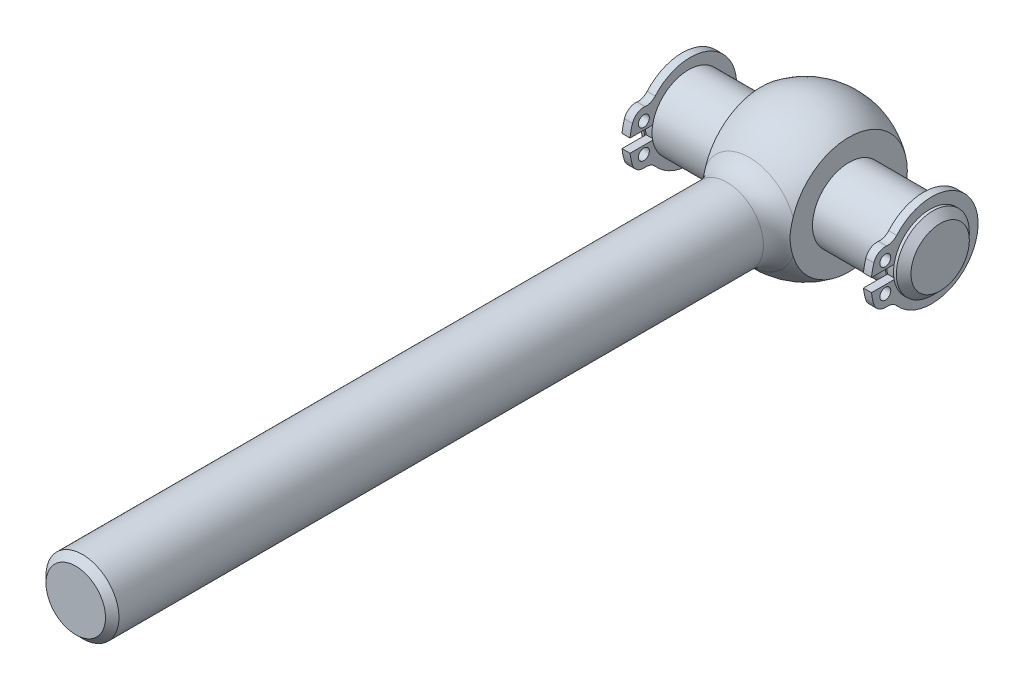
ISO-10303-21;
HEADER;
FILE_DESCRIPTION(('STEP AP214'),'2;1');
FILE_NAME('part.step','',(''),(''),'','','');
FILE_SCHEMA(('AUTOMOTIVE_DESIGN { 1 0 10303 214 1 1 1 1 }'));
ENDSEC;
DATA;
#1=APPLICATION_CONTEXT('core data for automotive mechanical design processes');
#2=APPLICATION_PROTOCOL_DEFINITION('international standard','automotive_design',2000,#1);
#3=PRODUCT_CONTEXT('',#1,'mechanical');
#4=PRODUCT('Part','Part','',(#3));
#5=PRODUCT_RELATED_PRODUCT_CATEGORY('part','',(#4));
#6=PRODUCT_DEFINITION_FORMATION('','',#4);
#7=PRODUCT_DEFINITION_CONTEXT('part definition',#1,'design');
#8=PRODUCT_DEFINITION('design','',#6,#7);
#9=PRODUCT_DEFINITION_SHAPE('','',#8);
#10=(LENGTH_UNIT() NAMED_UNIT(*) SI_UNIT(.MILLI.,.METRE.));
#11=(NAMED_UNIT(*) PLANE_ANGLE_UNIT() SI_UNIT($,.RADIAN.));
#12=(NAMED_UNIT(*) SI_UNIT($,.STERADIAN.) SOLID_ANGLE_UNIT());
#13=UNCERTAINTY_MEASURE_WITH_UNIT(LENGTH_MEASURE(1.E-05),#10,'distance_accuracy_value','');
#14=(GEOMETRIC_REPRESENTATION_CONTEXT(3) GLOBAL_UNCERTAINTY_ASSIGNED_CONTEXT((#13)) GLOBAL_UNIT_ASSIGNED_CONTEXT((#10,
#11,#12)) REPRESENTATION_CONTEXT('',''));
#15=CARTESIAN_POINT('',(0.,0.,0.));
#16=DIRECTION('',(0.,0.,1.));
#17=DIRECTION('',(1.,0.,0.));
#18=AXIS2_PLACEMENT_3D('',#15,#16,#17);
#19=CARTESIAN_POINT('',(-18.5,0.,0.));
#20=DIRECTION('',(-1.,0.,0.));
#21=DIRECTION('',(0.,1.,0.));
#22=AXIS2_PLACEMENT_3D('',#19,#20,#21);
#23=PLANE('',#22);
#24=CARTESIAN_POINT('',(-18.5,0.,0.));
#25=DIRECTION('',(-1.,0.,0.));
#26=DIRECTION('',(0.,1.,0.));
#27=AXIS2_PLACEMENT_3D('',#24,#25,#26);
#28=CIRCLE('',#27,4.);
#29=CARTESIAN_POINT('',(-18.5,4.,0.));
#30=VERTEX_POINT('',#29);
#31=EDGE_CURVE('E459',#30,#30,#28,.T.);
#32=ORIENTED_EDGE('',*,*,#31,.T.);
#33=EDGE_LOOP('',(#32));
#34=FACE_BOUND('',#33,.T.);
#35=ADVANCED_FACE('F14',(#34),#23,.T.);
#36=CARTESIAN_POINT('',(-18.5,0.,0.));
#37=DIRECTION('',(1.,0.,0.));
#38=DIRECTION('',(0.,-1.,0.));
#39=AXIS2_PLACEMENT_3D('',#36,#37,#38);
#40=CONICAL_SURFACE('',#39,4.,0.785398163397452);
#41=CARTESIAN_POINT('',(-17.5,0.,0.));
#42=DIRECTION('',(-1.,0.,0.));
#43=DIRECTION('',(0.,1.,0.));
#44=AXIS2_PLACEMENT_3D('',#41,#42,#43);
#45=CIRCLE('',#44,5.);
#46=CARTESIAN_POINT('',(-17.5,5.,0.));
#47=VERTEX_POINT('',#46);
#48=EDGE_CURVE('E456',#47,#47,#45,.T.);
#49=ORIENTED_EDGE('',*,*,#48,.T.);
#50=EDGE_LOOP('',(#49));
#51=FACE_BOUND('',#50,.T.);
#52=ORIENTED_EDGE('',*,*,#31,.F.);
#53=EDGE_LOOP('',(#52));
#54=FACE_BOUND('',#53,.T.);
#55=ADVANCED_FACE('F544',(#51,#54),#40,.T.);
#56=CARTESIAN_POINT('',(18.5,0.,0.));
#57=DIRECTION('',(-1.,0.,0.));
#58=DIRECTION('',(0.,1.,0.));
#59=AXIS2_PLACEMENT_3D('',#56,#57,#58);
#60=CYLINDRICAL_SURFACE('',#59,4.8);
#61=CARTESIAN_POINT('',(-16.,0.,0.));
#62=DIRECTION('',(-1.,0.,0.));
#63=DIRECTION('',(0.,1.,0.));
#64=AXIS2_PLACEMENT_3D('',#61,#62,#63);
#65=CIRCLE('',#64,4.8);
#66=CARTESIAN_POINT('',(-16.,-0.900002,4.71486971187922));
#67=VERTEX_POINT('',#66);
#68=CARTESIAN_POINT('',(-16.,0.900002,4.71486971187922));
#69=VERTEX_POINT('',#68);
#70=EDGE_CURVE('E447',#67,#69,#65,.T.);
#71=ORIENTED_EDGE('',*,*,#70,.T.);
#72=DIRECTION('',(-1.,0.,0.));
#73=VECTOR('',#72,1.);
#74=CARTESIAN_POINT('',(18.5,0.900002,4.71486971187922));
#75=LINE('',#74,#73);
#76=CARTESIAN_POINT('',(-17.1,0.900002,4.71486971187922));
#77=VERTEX_POINT('',#76);
#78=EDGE_CURVE('E33',#77,#69,#75,.F.);
#79=ORIENTED_EDGE('',*,*,#78,.F.);
#80=CARTESIAN_POINT('',(-17.1,0.,0.));
#81=DIRECTION('',(-1.,0.,0.));
#82=DIRECTION('',(0.,1.,0.));
#83=AXIS2_PLACEMENT_3D('',#80,#81,#82);
#84=CIRCLE('',#83,4.8);
#85=CARTESIAN_POINT('',(-17.1,-0.900002,4.71486971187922));
#86=VERTEX_POINT('',#85);
#87=EDGE_CURVE('E450',#86,#77,#84,.T.);
#88=ORIENTED_EDGE('',*,*,#87,.F.);
#89=DIRECTION('',(-1.,0.,0.));
#90=VECTOR('',#89,1.);
#91=CARTESIAN_POINT('',(18.5,-0.900002,4.71486971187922));
#92=LINE('',#91,#90);
#93=EDGE_CURVE('E470',#67,#86,#92,.T.);
#94=ORIENTED_EDGE('',*,*,#93,.F.);
#95=EDGE_LOOP('',(#71,#79,#88,#94));
#96=FACE_BOUND('',#95,.T.);
#97=ADVANCED_FACE('F550',(#96),#60,.T.);
#98=CARTESIAN_POINT('',(-17.1,0.,-5.));
#99=DIRECTION('',(1.,0.,0.));
#100=DIRECTION('',(0.,-1.,0.));
#101=AXIS2_PLACEMENT_3D('',#98,#99,#100);
#102=PLANE('',#101);
#103=DIRECTION('',(0.,0.,-1.));
#104=VECTOR('',#103,1.);
#105=CARTESIAN_POINT('',(-17.1,0.900002,-5.));
#106=LINE('',#105,#104);
#107=CARTESIAN_POINT('',(-17.1,0.900002,4.9183326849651));
#108=VERTEX_POINT('',#107);
#109=EDGE_CURVE('E325',#108,#77,#106,.T.);
#110=ORIENTED_EDGE('',*,*,#109,.F.);
#111=CARTESIAN_POINT('',(-17.1,0.,0.));
#112=DIRECTION('',(-1.,0.,0.));
#113=DIRECTION('',(0.,1.,0.));
#114=AXIS2_PLACEMENT_3D('',#111,#112,#113);
#115=CIRCLE('',#114,5.);
#116=CARTESIAN_POINT('',(-17.1,-0.900002,4.9183326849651));
#117=VERTEX_POINT('',#116);
#118=EDGE_CURVE('E453',#117,#108,#115,.T.);
#119=ORIENTED_EDGE('',*,*,#118,.F.);
#120=DIRECTION('',(0.,0.,1.));
#121=VECTOR('',#120,1.);
#122=CARTESIAN_POINT('',(-17.1,-0.900002,-5.));
#123=LINE('',#122,#121);
#124=EDGE_CURVE('E321',#86,#117,#123,.T.);
#125=ORIENTED_EDGE('',*,*,#124,.F.);
#126=ORIENTED_EDGE('',*,*,#87,.T.);
#127=EDGE_LOOP('',(#110,#119,#125,#126));
#128=FACE_BOUND('',#127,.T.);
#129=ADVANCED_FACE('F558',(#128),#102,.T.);
#130=CARTESIAN_POINT('',(18.5,0.,0.));
#131=DIRECTION('',(-1.,0.,0.));
#132=DIRECTION('',(0.,1.,0.));
#133=AXIS2_PLACEMENT_3D('',#130,#131,#132);
#134=CYLINDRICAL_SURFACE('',#133,5.);
#135=DIRECTION('',(-1.,0.,0.));
#136=VECTOR('',#135,1.);
#137=CARTESIAN_POINT('',(18.5,0.900002,4.9183326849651));
#138=LINE('',#137,#136);
#139=CARTESIAN_POINT('',(-17.101,0.900002,4.9183326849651));
#140=VERTEX_POINT('',#139);
#141=EDGE_CURVE('E327',#140,#108,#138,.F.);
#142=ORIENTED_EDGE('',*,*,#141,.F.);
#143=CARTESIAN_POINT('',(-17.101,0.,0.));
#144=DIRECTION('',(-1.,0.,0.));
#145=DIRECTION('',(0.,0.,1.));
#146=AXIS2_PLACEMENT_3D('',#143,#144,#145);
#147=CIRCLE('',#146,5.);
#148=CARTESIAN_POINT('',(-17.101,-0.900002,4.9183326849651));
#149=VERTEX_POINT('',#148);
#150=EDGE_CURVE('E234',#149,#140,#147,.F.);
#151=ORIENTED_EDGE('',*,*,#150,.F.);
#152=DIRECTION('',(-1.,0.,0.));
#153=VECTOR('',#152,1.);
#154=CARTESIAN_POINT('',(18.5,-0.900002,4.9183326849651));
#155=LINE('',#154,#153);
#156=EDGE_CURVE('E323',#117,#149,#155,.T.);
#157=ORIENTED_EDGE('',*,*,#156,.F.);
#158=ORIENTED_EDGE('',*,*,#118,.T.);
#159=EDGE_LOOP('',(#142,#151,#157,#158));
#160=FACE_BOUND('',#159,.T.);
#161=ORIENTED_EDGE('',*,*,#48,.F.);
#162=EDGE_LOOP('',(#161));
#163=FACE_BOUND('',#162,.T.);
#164=ADVANCED_FACE('F554',(#160,#163),#134,.T.);
#165=CARTESIAN_POINT('',(-17.101,-5.24923653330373,5.80103299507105));
#166=DIRECTION('',(-1.,0.,0.));
#167=DIRECTION('',(0.,0.,1.));
#168=AXIS2_PLACEMENT_3D('',#165,#166,#167);
#169=PLANE('',#168);
#170=CARTESIAN_POINT('',(-17.101,-1.9786,6.12));
#171=DIRECTION('',(1.,0.,0.));
#172=DIRECTION('',(0.,0.,-1.));
#173=AXIS2_PLACEMENT_3D('',#170,#171,#172);
#174=CIRCLE('',#173,0.75);
#175=CARTESIAN_POINT('',(-17.101,-1.9786,5.37));
#176=VERTEX_POINT('',#175);
#177=EDGE_CURVE('E299',#176,#176,#174,.T.);
#178=ORIENTED_EDGE('',*,*,#177,.T.);
#179=EDGE_LOOP('',(#178));
#180=FACE_BOUND('',#179,.T.);
#181=DIRECTION('',(0.,0.,1.));
#182=VECTOR('',#181,1.);
#183=CARTESIAN_POINT('',(-17.101,-0.900002,3.8974345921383));
#184=LINE('',#183,#182);
#185=CARTESIAN_POINT('',(-17.101,-0.900002,8.0148979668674));
#186=VERTEX_POINT('',#185);
#187=EDGE_CURVE('E291',#149,#186,#184,.T.);
#188=ORIENTED_EDGE('',*,*,#187,.F.);
#189=ORIENTED_EDGE('',*,*,#150,.T.);
#190=DIRECTION('',(0.,0.,-1.));
#191=VECTOR('',#190,1.);
#192=CARTESIAN_POINT('',(-17.101,0.900002,8.0149080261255));
#193=LINE('',#192,#191);
#194=CARTESIAN_POINT('',(-17.101,0.900002,8.0149080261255));
#195=VERTEX_POINT('',#194);
#196=EDGE_CURVE('E289',#195,#140,#193,.T.);
#197=ORIENTED_EDGE('',*,*,#196,.F.);
#198=CARTESIAN_POINT('',(-17.101,-0.000166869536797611,-0.241060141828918));
#199=DIRECTION('',(1.,0.,0.));
#200=DIRECTION('',(0.,0.,-1.));
#201=AXIS2_PLACEMENT_3D('',#198,#199,#200);
#202=CIRCLE('',#201,8.30489701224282);
#203=CARTESIAN_POINT('',(-17.101,2.4667155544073,7.6889969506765));
#204=VERTEX_POINT('',#203);
#205=EDGE_CURVE('E286',#204,#195,#202,.T.);
#206=ORIENTED_EDGE('',*,*,#205,.F.);
#207=CARTESIAN_POINT('',(-17.101,1.97848490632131,6.11997131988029));
#208=DIRECTION('',(1.,0.,0.));
#209=DIRECTION('',(0.,0.,-1.));
#210=AXIS2_PLACEMENT_3D('',#207,#208,#209);
#211=CIRCLE('',#210,1.64323175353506);
#212=CARTESIAN_POINT('',(-17.101,3.6139076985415,5.9599622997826));
#213=VERTEX_POINT('',#212);
#214=EDGE_CURVE('E283',#213,#204,#211,.T.);
#215=ORIENTED_EDGE('',*,*,#214,.F.);
#216=CARTESIAN_POINT('',(-17.101,5.24933117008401,5.80110016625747));
#217=DIRECTION('',(-1.,0.,0.));
#218=DIRECTION('',(0.,0.,-1.));
#219=AXIS2_PLACEMENT_3D('',#216,#217,#218);
#220=CIRCLE('',#219,1.6431211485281);
#221=CARTESIAN_POINT('',(-17.101,4.1715943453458,4.5608056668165));
#222=VERTEX_POINT('',#221);
#223=EDGE_CURVE('E280',#222,#213,#220,.T.);
#224=ORIENTED_EDGE('',*,*,#223,.F.);
#225=CARTESIAN_POINT('',(-17.101,0.,-0.240004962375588));
#226=DIRECTION('',(1.,0.,0.));
#227=DIRECTION('',(0.,0.,1.));
#228=AXIS2_PLACEMENT_3D('',#225,#226,#227);
#229=CIRCLE('',#228,6.36003003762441);
#230=CARTESIAN_POINT('',(-17.101,-4.1715943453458,4.5608056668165));
#231=VERTEX_POINT('',#230);
#232=EDGE_CURVE('E277',#231,#222,#229,.T.);
#233=ORIENTED_EDGE('',*,*,#232,.F.);
#234=CARTESIAN_POINT('',(-17.101,-5.24923653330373,5.80103299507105));
#235=DIRECTION('',(-1.,0.,0.));
#236=DIRECTION('',(0.,0.,-1.));
#237=AXIS2_PLACEMENT_3D('',#234,#235,#236);
#238=CIRCLE('',#237,1.64300837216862);
#239=CARTESIAN_POINT('',(-17.101,-3.6139895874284,5.9605445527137));
#240=VERTEX_POINT('',#239);
#241=EDGE_CURVE('E276',#240,#231,#238,.T.);
#242=ORIENTED_EDGE('',*,*,#241,.F.);
#243=CARTESIAN_POINT('',(-17.101,-1.9786582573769,6.12005314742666));
#244=DIRECTION('',(1.,0.,0.));
#245=DIRECTION('',(0.,0.,-1.));
#246=AXIS2_PLACEMENT_3D('',#243,#244,#245);
#247=CIRCLE('',#246,1.64309207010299);
#248=CARTESIAN_POINT('',(-17.101,-2.4667017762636,7.6889907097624));
#249=VERTEX_POINT('',#248);
#250=EDGE_CURVE('E296',#249,#240,#247,.T.);
#251=ORIENTED_EDGE('',*,*,#250,.F.);
#252=CARTESIAN_POINT('',(-17.101,0.000165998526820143,-0.24105463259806));
#253=DIRECTION('',(1.,0.,0.));
#254=DIRECTION('',(0.,0.,-1.));
#255=AXIS2_PLACEMENT_3D('',#252,#253,#254);
#256=CIRCLE('',#255,8.30488144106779);
#257=EDGE_CURVE('E293',#186,#249,#256,.T.);
#258=ORIENTED_EDGE('',*,*,#257,.F.);
#259=EDGE_LOOP('',(#188,#189,#197,#206,#215,#224,#233,#242,#251,#258));
#260=FACE_BOUND('',#259,.T.);
#261=CARTESIAN_POINT('',(-17.101,1.9786,6.12));
#262=DIRECTION('',(1.,0.,0.));
#263=DIRECTION('',(0.,0.,-1.));
#264=AXIS2_PLACEMENT_3D('',#261,#262,#263);
#265=CIRCLE('',#264,0.75);
#266=CARTESIAN_POINT('',(-17.101,1.9786,5.37));
#267=VERTEX_POINT('',#266);
#268=EDGE_CURVE('E303',#267,#267,#265,.T.);
#269=ORIENTED_EDGE('',*,*,#268,.T.);
#270=EDGE_LOOP('',(#269));
#271=FACE_BOUND('',#270,.T.);
#272=ADVANCED_FACE('F557',(#180,#260,#271),#169,.T.);
#273=CARTESIAN_POINT('',(-17.101,1.9786,6.12));
#274=DIRECTION('',(1.,0.,0.));
#275=DIRECTION('',(0.,-1.,0.));
#276=AXIS2_PLACEMENT_3D('',#273,#274,#275);
#277=CYLINDRICAL_SURFACE('',#276,0.75);
#278=ORIENTED_EDGE('',*,*,#268,.F.);
#279=EDGE_LOOP('',(#278));
#280=FACE_BOUND('',#279,.T.);
#281=CARTESIAN_POINT('',(-15.999,1.9786,6.12));
#282=DIRECTION('',(1.,0.,0.));
#283=DIRECTION('',(0.,0.,-1.));
#284=AXIS2_PLACEMENT_3D('',#281,#282,#283);
#285=CIRCLE('',#284,0.75);
#286=CARTESIAN_POINT('',(-15.999,1.9786,5.37));
#287=VERTEX_POINT('',#286);
#288=EDGE_CURVE('E270',#287,#287,#285,.T.);
#289=ORIENTED_EDGE('',*,*,#288,.T.);
#290=EDGE_LOOP('',(#289));
#291=FACE_BOUND('',#290,.T.);
#292=ADVANCED_FACE('F685',(#280,#291),#277,.F.);
#293=CARTESIAN_POINT('',(-17.101,-1.9786,6.12));
#294=DIRECTION('',(1.,0.,0.));
#295=DIRECTION('',(0.,-1.,0.));
#296=AXIS2_PLACEMENT_3D('',#293,#294,#295);
#297=CYLINDRICAL_SURFACE('',#296,0.75);
#298=ORIENTED_EDGE('',*,*,#177,.F.);
#299=EDGE_LOOP('',(#298));
#300=FACE_BOUND('',#299,.T.);
#301=CARTESIAN_POINT('',(-15.999,-1.9786,6.12));
#302=DIRECTION('',(1.,0.,0.));
#303=DIRECTION('',(0.,0.,-1.));
#304=AXIS2_PLACEMENT_3D('',#301,#302,#303);
#305=CIRCLE('',#304,0.75);
#306=CARTESIAN_POINT('',(-15.999,-1.9786,5.37));
#307=VERTEX_POINT('',#306);
#308=EDGE_CURVE('E262',#307,#307,#305,.T.);
#309=ORIENTED_EDGE('',*,*,#308,.T.);
#310=EDGE_LOOP('',(#309));
#311=FACE_BOUND('',#310,.T.);
#312=ADVANCED_FACE('F669',(#300,#311),#297,.F.);
#313=CARTESIAN_POINT('',(-17.101,-0.000166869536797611,-0.241060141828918));
#314=DIRECTION('',(1.,0.,0.));
#315=DIRECTION('',(0.,-1.,0.));
#316=AXIS2_PLACEMENT_3D('',#313,#314,#315);
#317=CYLINDRICAL_SURFACE('',#316,8.30489701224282);
#318=DIRECTION('',(1.,0.,0.));
#319=VECTOR('',#318,1.);
#320=CARTESIAN_POINT('',(-17.101,0.900002,8.0149080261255));
#321=LINE('',#320,#319);
#322=CARTESIAN_POINT('',(-15.999,0.900002,8.0149080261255));
#323=VERTEX_POINT('',#322);
#324=EDGE_CURVE('E312',#195,#323,#321,.T.);
#325=ORIENTED_EDGE('',*,*,#324,.T.);
#326=CARTESIAN_POINT('',(-15.999,-0.000166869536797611,-0.241060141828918));
#327=DIRECTION('',(1.,0.,0.));
#328=DIRECTION('',(0.,0.,-1.));
#329=AXIS2_PLACEMENT_3D('',#326,#327,#328);
#330=CIRCLE('',#329,8.30489701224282);
#331=CARTESIAN_POINT('',(-15.999,2.4667155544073,7.6889969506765));
#332=VERTEX_POINT('',#331);
#333=EDGE_CURVE('E248',#332,#323,#330,.T.);
#334=ORIENTED_EDGE('',*,*,#333,.F.);
#335=DIRECTION('',(1.,0.,0.));
#336=VECTOR('',#335,1.);
#337=CARTESIAN_POINT('',(-17.101,2.4667155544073,7.6889969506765));
#338=LINE('',#337,#336);
#339=EDGE_CURVE('E314',#204,#332,#338,.T.);
#340=ORIENTED_EDGE('',*,*,#339,.F.);
#341=ORIENTED_EDGE('',*,*,#205,.T.);
#342=EDGE_LOOP('',(#325,#334,#340,#341));
#343=FACE_BOUND('',#342,.T.);
#344=ADVANCED_FACE('F665',(#343),#317,.T.);
#345=CARTESIAN_POINT('',(-17.101,1.97848490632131,6.11997131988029));
#346=DIRECTION('',(1.,0.,0.));
#347=DIRECTION('',(0.,-1.,0.));
#348=AXIS2_PLACEMENT_3D('',#345,#346,#347);
#349=CYLINDRICAL_SURFACE('',#348,1.64323175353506);
#350=ORIENTED_EDGE('',*,*,#339,.T.);
#351=CARTESIAN_POINT('',(-15.999,1.97848490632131,6.11997131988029));
#352=DIRECTION('',(1.,0.,0.));
#353=DIRECTION('',(0.,0.,-1.));
#354=AXIS2_PLACEMENT_3D('',#351,#352,#353);
#355=CIRCLE('',#354,1.64323175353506);
#356=CARTESIAN_POINT('',(-15.999,3.6139076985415,5.9599622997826));
#357=VERTEX_POINT('',#356);
#358=EDGE_CURVE('E253',#357,#332,#355,.T.);
#359=ORIENTED_EDGE('',*,*,#358,.F.);
#360=DIRECTION('',(1.,0.,0.));
#361=VECTOR('',#360,1.);
#362=CARTESIAN_POINT('',(-17.101,3.6139076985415,5.9599622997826));
#363=LINE('',#362,#361);
#364=EDGE_CURVE('E316',#213,#357,#363,.T.);
#365=ORIENTED_EDGE('',*,*,#364,.F.);
#366=ORIENTED_EDGE('',*,*,#214,.T.);
#367=EDGE_LOOP('',(#350,#359,#365,#366));
#368=FACE_BOUND('',#367,.T.);
#369=ADVANCED_FACE('F661',(#368),#349,.T.);
#370=CARTESIAN_POINT('',(-17.101,5.24933117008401,5.80110016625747));
#371=DIRECTION('',(1.,0.,0.));
#372=DIRECTION('',(0.,-1.,0.));
#373=AXIS2_PLACEMENT_3D('',#370,#371,#372);
#374=CYLINDRICAL_SURFACE('',#373,1.6431211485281);
#375=ORIENTED_EDGE('',*,*,#364,.T.);
#376=CARTESIAN_POINT('',(-15.999,5.24933117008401,5.80110016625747));
#377=DIRECTION('',(-1.,0.,0.));
#378=DIRECTION('',(0.,0.,-1.));
#379=AXIS2_PLACEMENT_3D('',#376,#377,#378);
#380=CIRCLE('',#379,1.6431211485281);
#381=CARTESIAN_POINT('',(-15.999,4.1715943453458,4.5608056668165));
#382=VERTEX_POINT('',#381);
#383=EDGE_CURVE('E1498',#382,#357,#380,.T.);
#384=ORIENTED_EDGE('',*,*,#383,.F.);
#385=DIRECTION('',(1.,0.,0.));
#386=VECTOR('',#385,1.);
#387=CARTESIAN_POINT('',(-17.101,4.1715943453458,4.5608056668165));
#388=LINE('',#387,#386);
#389=EDGE_CURVE('E318',#222,#382,#388,.T.);
#390=ORIENTED_EDGE('',*,*,#389,.F.);
#391=ORIENTED_EDGE('',*,*,#223,.T.);
#392=EDGE_LOOP('',(#375,#384,#390,#391));
#393=FACE_BOUND('',#392,.T.);
#394=ADVANCED_FACE('F657',(#393),#374,.F.);
#395=CARTESIAN_POINT('',(-17.101,0.,-0.240004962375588));
#396=DIRECTION('',(1.,0.,0.));
#397=DIRECTION('',(0.,-1.,0.));
#398=AXIS2_PLACEMENT_3D('',#395,#396,#397);
#399=CYLINDRICAL_SURFACE('',#398,6.36003003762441);
#400=ORIENTED_EDGE('',*,*,#389,.T.);
#401=CARTESIAN_POINT('',(-15.999,0.,-0.240004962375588));
#402=DIRECTION('',(1.,0.,0.));
#403=DIRECTION('',(0.,0.,1.));
#404=AXIS2_PLACEMENT_3D('',#401,#402,#403);
#405=CIRCLE('',#404,6.36003003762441);
#406=CARTESIAN_POINT('',(-15.999,-4.1715943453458,4.5608056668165));
#407=VERTEX_POINT('',#406);
#408=EDGE_CURVE('E266',#407,#382,#405,.T.);
#409=ORIENTED_EDGE('',*,*,#408,.F.);
#410=DIRECTION('',(1.,0.,0.));
#411=VECTOR('',#410,1.);
#412=CARTESIAN_POINT('',(-17.101,-4.1715943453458,4.5608056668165));
#413=LINE('',#412,#411);
#414=EDGE_CURVE('E64',#231,#407,#413,.T.);
#415=ORIENTED_EDGE('',*,*,#414,.F.);
#416=ORIENTED_EDGE('',*,*,#232,.T.);
#417=EDGE_LOOP('',(#400,#409,#415,#416));
#418=FACE_BOUND('',#417,.T.);
#419=ADVANCED_FACE('F654',(#418),#399,.T.);
#420=CARTESIAN_POINT('',(-17.101,-5.24923653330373,5.80103299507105));
#421=DIRECTION('',(1.,0.,0.));
#422=DIRECTION('',(0.,-1.,0.));
#423=AXIS2_PLACEMENT_3D('',#420,#421,#422);
#424=CYLINDRICAL_SURFACE('',#423,1.64300837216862);
#425=ORIENTED_EDGE('',*,*,#414,.T.);
#426=CARTESIAN_POINT('',(-15.999,-5.24923653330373,5.80103299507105));
#427=DIRECTION('',(-1.,0.,0.));
#428=DIRECTION('',(0.,0.,-1.));
#429=AXIS2_PLACEMENT_3D('',#426,#427,#428);
#430=CIRCLE('',#429,1.64300837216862);
#431=CARTESIAN_POINT('',(-15.999,-3.6139895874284,5.9605445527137));
#432=VERTEX_POINT('',#431);
#433=EDGE_CURVE('E263',#432,#407,#430,.T.);
#434=ORIENTED_EDGE('',*,*,#433,.F.);
#435=DIRECTION('',(1.,0.,0.));
#436=VECTOR('',#435,1.);
#437=CARTESIAN_POINT('',(-17.101,-3.6139895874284,5.9605445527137));
#438=LINE('',#437,#436);
#439=EDGE_CURVE('E306',#240,#432,#438,.T.);
#440=ORIENTED_EDGE('',*,*,#439,.F.);
#441=ORIENTED_EDGE('',*,*,#241,.T.);
#442=EDGE_LOOP('',(#425,#434,#440,#441));
#443=FACE_BOUND('',#442,.T.);
#444=ADVANCED_FACE('F650',(#443),#424,.F.);
#445=CARTESIAN_POINT('',(-17.101,-1.9786582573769,6.12005314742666));
#446=DIRECTION('',(1.,0.,0.));
#447=DIRECTION('',(0.,-1.,0.));
#448=AXIS2_PLACEMENT_3D('',#445,#446,#447);
#449=CYLINDRICAL_SURFACE('',#448,1.64309207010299);
#450=ORIENTED_EDGE('',*,*,#439,.T.);
#451=CARTESIAN_POINT('',(-15.999,-1.9786582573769,6.12005314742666));
#452=DIRECTION('',(1.,0.,0.));
#453=DIRECTION('',(0.,0.,-1.));
#454=AXIS2_PLACEMENT_3D('',#451,#452,#453);
#455=CIRCLE('',#454,1.64309207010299);
#456=CARTESIAN_POINT('',(-15.999,-2.4667017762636,7.6889907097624));
#457=VERTEX_POINT('',#456);
#458=EDGE_CURVE('E259',#457,#432,#455,.T.);
#459=ORIENTED_EDGE('',*,*,#458,.F.);
#460=DIRECTION('',(1.,0.,0.));
#461=VECTOR('',#460,1.);
#462=CARTESIAN_POINT('',(-17.101,-2.4667017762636,7.6889907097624));
#463=LINE('',#462,#461);
#464=EDGE_CURVE('E308',#249,#457,#463,.T.);
#465=ORIENTED_EDGE('',*,*,#464,.F.);
#466=ORIENTED_EDGE('',*,*,#250,.T.);
#467=EDGE_LOOP('',(#450,#459,#465,#466));
#468=FACE_BOUND('',#467,.T.);
#469=ADVANCED_FACE('F653',(#468),#449,.T.);
#470=CARTESIAN_POINT('',(-17.101,0.000165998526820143,-0.24105463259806));
#471=DIRECTION('',(1.,0.,0.));
#472=DIRECTION('',(0.,-1.,0.));
#473=AXIS2_PLACEMENT_3D('',#470,#471,#472);
#474=CYLINDRICAL_SURFACE('',#473,8.30488144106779);
#475=ORIENTED_EDGE('',*,*,#464,.T.);
#476=CARTESIAN_POINT('',(-15.999,0.000165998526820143,-0.24105463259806));
#477=DIRECTION('',(1.,0.,0.));
#478=DIRECTION('',(0.,0.,-1.));
#479=AXIS2_PLACEMENT_3D('',#476,#477,#478);
#480=CIRCLE('',#479,8.30488144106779);
#481=CARTESIAN_POINT('',(-15.999,-0.900002,8.0148979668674));
#482=VERTEX_POINT('',#481);
#483=EDGE_CURVE('E251',#482,#457,#480,.T.);
#484=ORIENTED_EDGE('',*,*,#483,.F.);
#485=DIRECTION('',(1.,0.,0.));
#486=VECTOR('',#485,1.);
#487=CARTESIAN_POINT('',(-17.101,-0.900002,8.0148979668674));
#488=LINE('',#487,#486);
#489=EDGE_CURVE('E310',#186,#482,#488,.T.);
#490=ORIENTED_EDGE('',*,*,#489,.F.);
#491=ORIENTED_EDGE('',*,*,#257,.T.);
#492=EDGE_LOOP('',(#475,#484,#490,#491));
#493=FACE_BOUND('',#492,.T.);
#494=ADVANCED_FACE('F675',(#493),#474,.T.);
#495=CARTESIAN_POINT('',(-17.101,-0.900002,3.8974345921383));
#496=DIRECTION('',(0.,1.,0.));
#497=DIRECTION('',(1.,0.,0.));
#498=AXIS2_PLACEMENT_3D('',#495,#496,#497);
#499=PLANE('',#498);
#500=ORIENTED_EDGE('',*,*,#124,.T.);
#501=ORIENTED_EDGE('',*,*,#156,.T.);
#502=ORIENTED_EDGE('',*,*,#187,.T.);
#503=ORIENTED_EDGE('',*,*,#489,.T.);
#504=DIRECTION('',(0.,0.,1.));
#505=VECTOR('',#504,1.);
#506=CARTESIAN_POINT('',(-15.999,-0.900002,3.8974345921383));
#507=LINE('',#506,#505);
#508=CARTESIAN_POINT('',(-15.999,-0.900002,4.9183326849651));
#509=VERTEX_POINT('',#508);
#510=EDGE_CURVE('E249',#509,#482,#507,.T.);
#511=ORIENTED_EDGE('',*,*,#510,.F.);
#512=DIRECTION('',(-1.,0.,0.));
#513=VECTOR('',#512,1.);
#514=CARTESIAN_POINT('',(18.5,-0.900002,4.9183326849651));
#515=LINE('',#514,#513);
#516=CARTESIAN_POINT('',(-16.,-0.900002,4.9183326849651));
#517=VERTEX_POINT('',#516);
#518=EDGE_CURVE('E229',#517,#509,#515,.F.);
#519=ORIENTED_EDGE('',*,*,#518,.F.);
#520=DIRECTION('',(0.,0.,1.));
#521=VECTOR('',#520,1.);
#522=CARTESIAN_POINT('',(-16.,-0.900002,-4.8));
#523=LINE('',#522,#521);
#524=EDGE_CURVE('E241',#67,#517,#523,.T.);
#525=ORIENTED_EDGE('',*,*,#524,.F.);
#526=ORIENTED_EDGE('',*,*,#93,.T.);
#527=EDGE_LOOP('',(#500,#501,#502,#503,#511,#519,#525,#526));
#528=FACE_BOUND('',#527,.T.);
#529=ADVANCED_FACE('F569',(#528),#499,.T.);
#530=CARTESIAN_POINT('',(-16.,0.,-4.8));
#531=DIRECTION('',(-1.,0.,0.));
#532=DIRECTION('',(0.,1.,0.));
#533=AXIS2_PLACEMENT_3D('',#530,#531,#532);
#534=PLANE('',#533);
#535=CARTESIAN_POINT('',(-16.,0.,0.));
#536=DIRECTION('',(-1.,0.,0.));
#537=DIRECTION('',(0.,1.,0.));
#538=AXIS2_PLACEMENT_3D('',#535,#536,#537);
#539=CIRCLE('',#538,5.);
#540=CARTESIAN_POINT('',(-16.,0.900002,4.9183326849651));
#541=VERTEX_POINT('',#540);
#542=EDGE_CURVE('E445',#517,#541,#539,.T.);
#543=ORIENTED_EDGE('',*,*,#542,.T.);
#544=DIRECTION('',(0.,0.,-1.));
#545=VECTOR('',#544,1.);
#546=CARTESIAN_POINT('',(-16.,0.900002,-4.8));
#547=LINE('',#546,#545);
#548=EDGE_CURVE('E240',#541,#69,#547,.T.);
#549=ORIENTED_EDGE('',*,*,#548,.T.);
#550=ORIENTED_EDGE('',*,*,#70,.F.);
#551=ORIENTED_EDGE('',*,*,#524,.T.);
#552=EDGE_LOOP('',(#543,#549,#550,#551));
#553=FACE_BOUND('',#552,.T.);
#554=ADVANCED_FACE('F566',(#553),#534,.T.);
#555=CARTESIAN_POINT('',(-17.101,0.900002,8.0149080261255));
#556=DIRECTION('',(0.,-1.,0.));
#557=DIRECTION('',(-1.,0.,0.));
#558=AXIS2_PLACEMENT_3D('',#555,#556,#557);
#559=PLANE('',#558);
#560=ORIENTED_EDGE('',*,*,#196,.T.);
#561=ORIENTED_EDGE('',*,*,#141,.T.);
#562=ORIENTED_EDGE('',*,*,#109,.T.);
#563=ORIENTED_EDGE('',*,*,#78,.T.);
#564=ORIENTED_EDGE('',*,*,#548,.F.);
#565=DIRECTION('',(-1.,0.,0.));
#566=VECTOR('',#565,1.);
#567=CARTESIAN_POINT('',(18.5,0.900002,4.9183326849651));
#568=LINE('',#567,#566);
#569=CARTESIAN_POINT('',(-15.999,0.900002,4.9183326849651));
#570=VERTEX_POINT('',#569);
#571=EDGE_CURVE('E226',#570,#541,#568,.T.);
#572=ORIENTED_EDGE('',*,*,#571,.F.);
#573=DIRECTION('',(0.,0.,-1.));
#574=VECTOR('',#573,1.);
#575=CARTESIAN_POINT('',(-15.999,0.900002,8.0149080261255));
#576=LINE('',#575,#574);
#577=EDGE_CURVE('E239',#323,#570,#576,.T.);
#578=ORIENTED_EDGE('',*,*,#577,.F.);
#579=ORIENTED_EDGE('',*,*,#324,.F.);
#580=EDGE_LOOP('',(#560,#561,#562,#563,#564,#572,#578,#579));
#581=FACE_BOUND('',#580,.T.);
#582=ADVANCED_FACE('F238',(#581),#559,.T.);
#583=CARTESIAN_POINT('',(-15.999,-5.24923653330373,5.80103299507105));
#584=DIRECTION('',(-1.,0.,0.));
#585=DIRECTION('',(0.,0.,1.));
#586=AXIS2_PLACEMENT_3D('',#583,#584,#585);
#587=PLANE('',#586);
#588=CARTESIAN_POINT('',(-15.999,0.,0.));
#589=DIRECTION('',(-1.,0.,0.));
#590=DIRECTION('',(0.,0.,1.));
#591=AXIS2_PLACEMENT_3D('',#588,#589,#590);
#592=CIRCLE('',#591,5.);
#593=EDGE_CURVE('E222',#509,#570,#592,.F.);
#594=ORIENTED_EDGE('',*,*,#593,.F.);
#595=ORIENTED_EDGE('',*,*,#510,.T.);
#596=ORIENTED_EDGE('',*,*,#483,.T.);
#597=ORIENTED_EDGE('',*,*,#458,.T.);
#598=ORIENTED_EDGE('',*,*,#433,.T.);
#599=ORIENTED_EDGE('',*,*,#408,.T.);
#600=ORIENTED_EDGE('',*,*,#383,.T.);
#601=ORIENTED_EDGE('',*,*,#358,.T.);
#602=ORIENTED_EDGE('',*,*,#333,.T.);
#603=ORIENTED_EDGE('',*,*,#577,.T.);
#604=EDGE_LOOP('',(#594,#595,#596,#597,#598,#599,#600,#601,#602,#603));
#605=FACE_BOUND('',#604,.T.);
#606=ORIENTED_EDGE('',*,*,#308,.F.);
#607=EDGE_LOOP('',(#606));
#608=FACE_BOUND('',#607,.T.);
#609=ORIENTED_EDGE('',*,*,#288,.F.);
#610=EDGE_LOOP('',(#609));
#611=FACE_BOUND('',#610,.T.);
#612=ADVANCED_FACE('F244',(#605,#608,#611),#587,.F.);
#613=CARTESIAN_POINT('',(18.5,0.,0.));
#614=DIRECTION('',(-1.,0.,0.));
#615=DIRECTION('',(0.,1.,0.));
#616=AXIS2_PLACEMENT_3D('',#613,#614,#615);
#617=CYLINDRICAL_SURFACE('',#616,5.);
#618=CARTESIAN_POINT('',(-6.,0.,0.));
#619=DIRECTION('',(1.,0.,0.));
#620=DIRECTION('',(0.,0.,-1.));
#621=AXIS2_PLACEMENT_3D('',#618,#619,#620);
#622=CIRCLE('',#621,5.);
#623=CARTESIAN_POINT('',(-6.,0.,-5.));
#624=VERTEX_POINT('',#623);
#625=EDGE_CURVE('E18',#624,#624,#622,.T.);
#626=ORIENTED_EDGE('',*,*,#625,.F.);
#627=EDGE_LOOP('',(#626));
#628=FACE_BOUND('',#627,.T.);
#629=ORIENTED_EDGE('',*,*,#593,.T.);
#630=ORIENTED_EDGE('',*,*,#571,.T.);
#631=ORIENTED_EDGE('',*,*,#542,.F.);
#632=ORIENTED_EDGE('',*,*,#518,.T.);
#633=EDGE_LOOP('',(#629,#630,#631,#632));
#634=FACE_BOUND('',#633,.T.);
#635=ADVANCED_FACE('F224',(#628,#634),#617,.T.);
#636=DIRECTION('',(-1.,0.,0.));
#637=VECTOR('',#636,1.);
#638=CARTESIAN_POINT('',(18.5,0.900002,4.9183326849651));
#639=LINE('',#638,#637);
#640=CARTESIAN_POINT('',(15.999,0.900002,4.9183326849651));
#641=VERTEX_POINT('',#640);
#642=CARTESIAN_POINT('',(16.,0.900002,4.9183326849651));
#643=VERTEX_POINT('',#642);
#644=EDGE_CURVE('E425',#641,#643,#639,.F.);
#645=ORIENTED_EDGE('',*,*,#644,.F.);
#646=CARTESIAN_POINT('',(15.999,0.,0.));
#647=DIRECTION('',(-1.,0.,0.));
#648=DIRECTION('',(0.,0.,1.));
#649=AXIS2_PLACEMENT_3D('',#646,#647,#648);
#650=CIRCLE('',#649,5.);
#651=CARTESIAN_POINT('',(15.999,-0.900002,4.9183326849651));
#652=VERTEX_POINT('',#651);
#653=EDGE_CURVE('E466',#652,#641,#650,.F.);
#654=ORIENTED_EDGE('',*,*,#653,.F.);
#655=DIRECTION('',(-1.,0.,0.));
#656=VECTOR('',#655,1.);
#657=CARTESIAN_POINT('',(18.5,-0.900002,4.9183326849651));
#658=LINE('',#657,#656);
#659=CARTESIAN_POINT('',(16.,-0.900002,4.9183326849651));
#660=VERTEX_POINT('',#659);
#661=EDGE_CURVE('E421',#660,#652,#658,.T.);
#662=ORIENTED_EDGE('',*,*,#661,.F.);
#663=CARTESIAN_POINT('',(16.,0.,0.));
#664=DIRECTION('',(-1.,0.,0.));
#665=DIRECTION('',(0.,1.,0.));
#666=AXIS2_PLACEMENT_3D('',#663,#664,#665);
#667=CIRCLE('',#666,5.);
#668=EDGE_CURVE('E442',#660,#643,#667,.T.);
#669=ORIENTED_EDGE('',*,*,#668,.T.);
#670=EDGE_LOOP('',(#645,#654,#662,#669));
#671=FACE_BOUND('',#670,.T.);
#672=CARTESIAN_POINT('',(6.,0.,0.));
#673=DIRECTION('',(1.,0.,0.));
#674=DIRECTION('',(0.,0.,1.));
#675=AXIS2_PLACEMENT_3D('',#672,#673,#674);
#676=CIRCLE('',#675,5.);
#677=CARTESIAN_POINT('',(6.,0.,5.));
#678=VERTEX_POINT('',#677);
#679=EDGE_CURVE('E9',#678,#678,#676,.T.);
#680=ORIENTED_EDGE('',*,*,#679,.T.);
#681=EDGE_LOOP('',(#680));
#682=FACE_BOUND('',#681,.T.);
#683=ADVANCED_FACE('F573',(#671,#682),#617,.T.);
#684=CARTESIAN_POINT('',(18.5,0.,0.));
#685=DIRECTION('',(-1.,0.,0.));
#686=DIRECTION('',(0.,1.,0.));
#687=AXIS2_PLACEMENT_3D('',#684,#685,#686);
#688=CYLINDRICAL_SURFACE('',#687,4.8);
#689=CARTESIAN_POINT('',(17.1,0.,0.));
#690=DIRECTION('',(-1.,0.,0.));
#691=DIRECTION('',(0.,1.,0.));
#692=AXIS2_PLACEMENT_3D('',#689,#690,#691);
#693=CIRCLE('',#692,4.8);
#694=CARTESIAN_POINT('',(17.1,-0.900002,4.71486971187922));
#695=VERTEX_POINT('',#694);
#696=CARTESIAN_POINT('',(17.1,0.900002,4.71486971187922));
#697=VERTEX_POINT('',#696);
#698=EDGE_CURVE('E436',#695,#697,#693,.T.);
#699=ORIENTED_EDGE('',*,*,#698,.T.);
#700=DIRECTION('',(-1.,0.,0.));
#701=VECTOR('',#700,1.);
#702=CARTESIAN_POINT('',(18.5,0.900002,4.71486971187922));
#703=LINE('',#702,#701);
#704=CARTESIAN_POINT('',(16.,0.900002,4.71486971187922));
#705=VERTEX_POINT('',#704);
#706=EDGE_CURVE('E464',#705,#697,#703,.F.);
#707=ORIENTED_EDGE('',*,*,#706,.F.);
#708=CARTESIAN_POINT('',(16.,0.,0.));
#709=DIRECTION('',(-1.,0.,0.));
#710=DIRECTION('',(0.,1.,0.));
#711=AXIS2_PLACEMENT_3D('',#708,#709,#710);
#712=CIRCLE('',#711,4.8);
#713=CARTESIAN_POINT('',(16.,-0.900002,4.71486971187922));
#714=VERTEX_POINT('',#713);
#715=EDGE_CURVE('E439',#714,#705,#712,.T.);
#716=ORIENTED_EDGE('',*,*,#715,.F.);
#717=DIRECTION('',(-1.,0.,0.));
#718=VECTOR('',#717,1.);
#719=CARTESIAN_POINT('',(18.5,-0.900002,4.71486971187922));
#720=LINE('',#719,#718);
#721=EDGE_CURVE('E462',#695,#714,#720,.T.);
#722=ORIENTED_EDGE('',*,*,#721,.F.);
#723=EDGE_LOOP('',(#699,#707,#716,#722));
#724=FACE_BOUND('',#723,.T.);
#725=ADVANCED_FACE('F581',(#724),#688,.T.);
#726=CARTESIAN_POINT('',(17.1,0.,-4.8));
#727=DIRECTION('',(-1.,0.,0.));
#728=DIRECTION('',(0.,1.,0.));
#729=AXIS2_PLACEMENT_3D('',#726,#727,#728);
#730=PLANE('',#729);
#731=CARTESIAN_POINT('',(17.1,0.,0.));
#732=DIRECTION('',(-1.,0.,0.));
#733=DIRECTION('',(0.,1.,0.));
#734=AXIS2_PLACEMENT_3D('',#731,#732,#733);
#735=CIRCLE('',#734,5.);
#736=CARTESIAN_POINT('',(17.1,-0.900002,4.9183326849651));
#737=VERTEX_POINT('',#736);
#738=CARTESIAN_POINT('',(17.1,0.900002,4.9183326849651));
#739=VERTEX_POINT('',#738);
#740=EDGE_CURVE('E433',#737,#739,#735,.T.);
#741=ORIENTED_EDGE('',*,*,#740,.T.);
#742=DIRECTION('',(0.,0.,-1.));
#743=VECTOR('',#742,1.);
#744=CARTESIAN_POINT('',(17.1,0.900002,-4.8));
#745=LINE('',#744,#743);
#746=EDGE_CURVE('E368',#739,#697,#745,.T.);
#747=ORIENTED_EDGE('',*,*,#746,.T.);
#748=ORIENTED_EDGE('',*,*,#698,.F.);
#749=DIRECTION('',(0.,0.,1.));
#750=VECTOR('',#749,1.);
#751=CARTESIAN_POINT('',(17.1,-0.900002,-4.8));
#752=LINE('',#751,#750);
#753=EDGE_CURVE('E364',#695,#737,#752,.T.);
#754=ORIENTED_EDGE('',*,*,#753,.T.);
#755=EDGE_LOOP('',(#741,#747,#748,#754));
#756=FACE_BOUND('',#755,.T.);
#757=ADVANCED_FACE('F584',(#756),#730,.T.);
#758=CARTESIAN_POINT('',(18.5,0.,0.));
#759=DIRECTION('',(-1.,0.,0.));
#760=DIRECTION('',(0.,1.,0.));
#761=AXIS2_PLACEMENT_3D('',#758,#759,#760);
#762=CYLINDRICAL_SURFACE('',#761,5.);
#763=CARTESIAN_POINT('',(17.5,0.,0.));
#764=DIRECTION('',(-1.,0.,0.));
#765=DIRECTION('',(0.,1.,0.));
#766=AXIS2_PLACEMENT_3D('',#763,#764,#765);
#767=CIRCLE('',#766,5.);
#768=CARTESIAN_POINT('',(17.5,5.,0.));
#769=VERTEX_POINT('',#768);
#770=EDGE_CURVE('E430',#769,#769,#767,.T.);
#771=ORIENTED_EDGE('',*,*,#770,.T.);
#772=EDGE_LOOP('',(#771));
#773=FACE_BOUND('',#772,.T.);
#774=CARTESIAN_POINT('',(17.101,0.,0.));
#775=DIRECTION('',(-1.,0.,0.));
#776=DIRECTION('',(0.,0.,1.));
#777=AXIS2_PLACEMENT_3D('',#774,#775,#776);
#778=CIRCLE('',#777,5.);
#779=CARTESIAN_POINT('',(17.101,-0.900002,4.9183326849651));
#780=VERTEX_POINT('',#779);
#781=CARTESIAN_POINT('',(17.101,0.900002,4.9183326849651));
#782=VERTEX_POINT('',#781);
#783=EDGE_CURVE('E468',#780,#782,#778,.F.);
#784=ORIENTED_EDGE('',*,*,#783,.T.);
#785=DIRECTION('',(-1.,0.,0.));
#786=VECTOR('',#785,1.);
#787=CARTESIAN_POINT('',(18.5,0.900002,4.9183326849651));
#788=LINE('',#787,#786);
#789=EDGE_CURVE('E366',#782,#739,#788,.T.);
#790=ORIENTED_EDGE('',*,*,#789,.T.);
#791=ORIENTED_EDGE('',*,*,#740,.F.);
#792=DIRECTION('',(-1.,0.,0.));
#793=VECTOR('',#792,1.);
#794=CARTESIAN_POINT('',(18.5,-0.900002,4.9183326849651));
#795=LINE('',#794,#793);
#796=EDGE_CURVE('E362',#737,#780,#795,.F.);
#797=ORIENTED_EDGE('',*,*,#796,.T.);
#798=EDGE_LOOP('',(#784,#790,#791,#797));
#799=FACE_BOUND('',#798,.T.);
#800=ADVANCED_FACE('F579',(#773,#799),#762,.T.);
#801=CARTESIAN_POINT('',(16.,0.,-5.));
#802=DIRECTION('',(1.,0.,0.));
#803=DIRECTION('',(0.,-1.,0.));
#804=AXIS2_PLACEMENT_3D('',#801,#802,#803);
#805=PLANE('',#804);
#806=DIRECTION('',(0.,0.,-1.));
#807=VECTOR('',#806,1.);
#808=CARTESIAN_POINT('',(16.,0.900002,-5.));
#809=LINE('',#808,#807);
#810=EDGE_CURVE('E423',#643,#705,#809,.T.);
#811=ORIENTED_EDGE('',*,*,#810,.F.);
#812=ORIENTED_EDGE('',*,*,#668,.F.);
#813=DIRECTION('',(0.,0.,1.));
#814=VECTOR('',#813,1.);
#815=CARTESIAN_POINT('',(16.,-0.900002,-5.));
#816=LINE('',#815,#814);
#817=EDGE_CURVE('E419',#714,#660,#816,.T.);
#818=ORIENTED_EDGE('',*,*,#817,.F.);
#819=ORIENTED_EDGE('',*,*,#715,.T.);
#820=EDGE_LOOP('',(#811,#812,#818,#819));
#821=FACE_BOUND('',#820,.T.);
#822=ADVANCED_FACE('F575',(#821),#805,.T.);
#823=CARTESIAN_POINT('',(17.5,0.,0.));
#824=DIRECTION('',(-1.,0.,0.));
#825=DIRECTION('',(0.,1.,0.));
#826=AXIS2_PLACEMENT_3D('',#823,#824,#825);
#827=CONICAL_SURFACE('',#826,5.,0.78539816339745);
#828=CARTESIAN_POINT('',(18.5,0.,0.));
#829=DIRECTION('',(-1.,0.,0.));
#830=DIRECTION('',(0.,1.,0.));
#831=AXIS2_PLACEMENT_3D('',#828,#829,#830);
#832=CIRCLE('',#831,4.);
#833=CARTESIAN_POINT('',(18.5,4.,0.));
#834=VERTEX_POINT('',#833);
#835=EDGE_CURVE('E427',#834,#834,#832,.T.);
#836=ORIENTED_EDGE('',*,*,#835,.T.);
#837=EDGE_LOOP('',(#836));
#838=FACE_BOUND('',#837,.T.);
#839=ORIENTED_EDGE('',*,*,#770,.F.);
#840=EDGE_LOOP('',(#839));
#841=FACE_BOUND('',#840,.T.);
#842=ADVANCED_FACE('F578',(#838,#841),#827,.T.);
#843=CARTESIAN_POINT('',(18.5,0.,-4.));
#844=DIRECTION('',(1.,0.,0.));
#845=DIRECTION('',(0.,-1.,0.));
#846=AXIS2_PLACEMENT_3D('',#843,#844,#845);
#847=PLANE('',#846);
#848=ORIENTED_EDGE('',*,*,#835,.F.);
#849=EDGE_LOOP('',(#848));
#850=FACE_BOUND('',#849,.T.);
#851=ADVANCED_FACE('F594',(#850),#847,.T.);
#852=CARTESIAN_POINT('',(15.999,-5.24923653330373,5.80103299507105));
#853=DIRECTION('',(1.,0.,0.));
#854=DIRECTION('',(0.,-1.,0.));
#855=AXIS2_PLACEMENT_3D('',#852,#853,#854);
#856=CYLINDRICAL_SURFACE('',#855,1.64300837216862);
#857=DIRECTION('',(1.,0.,0.));
#858=VECTOR('',#857,1.);
#859=CARTESIAN_POINT('',(15.999,-4.1715943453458,4.5608056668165));
#860=LINE('',#859,#858);
#861=CARTESIAN_POINT('',(15.999,-4.1715943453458,4.5608056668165));
#862=VERTEX_POINT('',#861);
#863=CARTESIAN_POINT('',(17.101,-4.1715943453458,4.5608056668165));
#864=VERTEX_POINT('',#863);
#865=EDGE_CURVE('E417',#862,#864,#860,.T.);
#866=ORIENTED_EDGE('',*,*,#865,.T.);
#867=CARTESIAN_POINT('',(17.101,-5.24923653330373,5.80103299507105));
#868=DIRECTION('',(-1.,0.,0.));
#869=DIRECTION('',(0.,0.,-1.));
#870=AXIS2_PLACEMENT_3D('',#867,#868,#869);
#871=CIRCLE('',#870,1.64300837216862);
#872=CARTESIAN_POINT('',(17.101,-3.6139895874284,5.9605445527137));
#873=VERTEX_POINT('',#872);
#874=EDGE_CURVE('E329',#873,#864,#871,.T.);
#875=ORIENTED_EDGE('',*,*,#874,.F.);
#876=DIRECTION('',(1.,0.,0.));
#877=VECTOR('',#876,1.);
#878=CARTESIAN_POINT('',(15.999,-3.6139895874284,5.9605445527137));
#879=LINE('',#878,#877);
#880=CARTESIAN_POINT('',(15.999,-3.6139895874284,5.9605445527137));
#881=VERTEX_POINT('',#880);
#882=EDGE_CURVE('E403',#881,#873,#879,.T.);
#883=ORIENTED_EDGE('',*,*,#882,.F.);
#884=CARTESIAN_POINT('',(15.999,-5.24923653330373,5.80103299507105));
#885=DIRECTION('',(-1.,0.,0.));
#886=DIRECTION('',(0.,0.,-1.));
#887=AXIS2_PLACEMENT_3D('',#884,#885,#886);
#888=CIRCLE('',#887,1.64300837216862);
#889=EDGE_CURVE('E371',#881,#862,#888,.T.);
#890=ORIENTED_EDGE('',*,*,#889,.T.);
#891=EDGE_LOOP('',(#866,#875,#883,#890));
#892=FACE_BOUND('',#891,.T.);
#893=ADVANCED_FACE('F598',(#892),#856,.F.);
#894=CARTESIAN_POINT('',(15.999,0.,-0.240004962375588));
#895=DIRECTION('',(1.,0.,0.));
#896=DIRECTION('',(0.,-1.,0.));
#897=AXIS2_PLACEMENT_3D('',#894,#895,#896);
#898=CYLINDRICAL_SURFACE('',#897,6.36003003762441);
#899=DIRECTION('',(1.,0.,0.));
#900=VECTOR('',#899,1.);
#901=CARTESIAN_POINT('',(15.999,4.1715943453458,4.5608056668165));
#902=LINE('',#901,#900);
#903=CARTESIAN_POINT('',(15.999,4.1715943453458,4.5608056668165));
#904=VERTEX_POINT('',#903);
#905=CARTESIAN_POINT('',(17.101,4.1715943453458,4.5608056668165));
#906=VERTEX_POINT('',#905);
#907=EDGE_CURVE('E415',#904,#906,#902,.T.);
#908=ORIENTED_EDGE('',*,*,#907,.T.);
#909=CARTESIAN_POINT('',(17.101,0.,-0.240004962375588));
#910=DIRECTION('',(1.,0.,0.));
#911=DIRECTION('',(0.,0.,1.));
#912=AXIS2_PLACEMENT_3D('',#909,#910,#911);
#913=CIRCLE('',#912,6.36003003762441);
#914=EDGE_CURVE('E330',#864,#906,#913,.T.);
#915=ORIENTED_EDGE('',*,*,#914,.F.);
#916=ORIENTED_EDGE('',*,*,#865,.F.);
#917=CARTESIAN_POINT('',(15.999,0.,-0.240004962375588));
#918=DIRECTION('',(1.,0.,0.));
#919=DIRECTION('',(0.,0.,1.));
#920=AXIS2_PLACEMENT_3D('',#917,#918,#919);
#921=CIRCLE('',#920,6.36003003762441);
#922=EDGE_CURVE('E372',#862,#904,#921,.T.);
#923=ORIENTED_EDGE('',*,*,#922,.T.);
#924=EDGE_LOOP('',(#908,#915,#916,#923));
#925=FACE_BOUND('',#924,.T.);
#926=ADVANCED_FACE('F602',(#925),#898,.T.);
#927=CARTESIAN_POINT('',(15.999,5.24933117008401,5.80110016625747));
#928=DIRECTION('',(1.,0.,0.));
#929=DIRECTION('',(0.,-1.,0.));
#930=AXIS2_PLACEMENT_3D('',#927,#928,#929);
#931=CYLINDRICAL_SURFACE('',#930,1.6431211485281);
#932=DIRECTION('',(1.,0.,0.));
#933=VECTOR('',#932,1.);
#934=CARTESIAN_POINT('',(15.999,3.6139076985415,5.9599622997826));
#935=LINE('',#934,#933);
#936=CARTESIAN_POINT('',(15.999,3.6139076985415,5.9599622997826));
#937=VERTEX_POINT('',#936);
#938=CARTESIAN_POINT('',(17.101,3.6139076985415,5.9599622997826));
#939=VERTEX_POINT('',#938);
#940=EDGE_CURVE('E413',#937,#939,#935,.T.);
#941=ORIENTED_EDGE('',*,*,#940,.T.);
#942=CARTESIAN_POINT('',(17.101,5.24933117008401,5.80110016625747));
#943=DIRECTION('',(-1.,0.,0.));
#944=DIRECTION('',(0.,0.,-1.));
#945=AXIS2_PLACEMENT_3D('',#942,#943,#944);
#946=CIRCLE('',#945,1.6431211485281);
#947=EDGE_CURVE('E333',#906,#939,#946,.T.);
#948=ORIENTED_EDGE('',*,*,#947,.F.);
#949=ORIENTED_EDGE('',*,*,#907,.F.);
#950=CARTESIAN_POINT('',(15.999,5.24933117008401,5.80110016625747));
#951=DIRECTION('',(-1.,0.,0.));
#952=DIRECTION('',(0.,0.,-1.));
#953=AXIS2_PLACEMENT_3D('',#950,#951,#952);
#954=CIRCLE('',#953,1.6431211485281);
#955=EDGE_CURVE('E375',#904,#937,#954,.T.);
#956=ORIENTED_EDGE('',*,*,#955,.T.);
#957=EDGE_LOOP('',(#941,#948,#949,#956));
#958=FACE_BOUND('',#957,.T.);
#959=ADVANCED_FACE('F606',(#958),#931,.F.);
#960=CARTESIAN_POINT('',(15.999,1.97848490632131,6.11997131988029));
#961=DIRECTION('',(1.,0.,0.));
#962=DIRECTION('',(0.,-1.,0.));
#963=AXIS2_PLACEMENT_3D('',#960,#961,#962);
#964=CYLINDRICAL_SURFACE('',#963,1.64323175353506);
#965=DIRECTION('',(1.,0.,0.));
#966=VECTOR('',#965,1.);
#967=CARTESIAN_POINT('',(15.999,2.4667155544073,7.6889969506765));
#968=LINE('',#967,#966);
#969=CARTESIAN_POINT('',(15.999,2.4667155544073,7.6889969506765));
#970=VERTEX_POINT('',#969);
#971=CARTESIAN_POINT('',(17.101,2.4667155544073,7.6889969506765));
#972=VERTEX_POINT('',#971);
#973=EDGE_CURVE('E411',#970,#972,#968,.T.);
#974=ORIENTED_EDGE('',*,*,#973,.T.);
#975=CARTESIAN_POINT('',(17.101,1.97848490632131,6.11997131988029));
#976=DIRECTION('',(1.,0.,0.));
#977=DIRECTION('',(0.,0.,-1.));
#978=AXIS2_PLACEMENT_3D('',#975,#976,#977);
#979=CIRCLE('',#978,1.64323175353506);
#980=EDGE_CURVE('E336',#939,#972,#979,.T.);
#981=ORIENTED_EDGE('',*,*,#980,.F.);
#982=ORIENTED_EDGE('',*,*,#940,.F.);
#983=CARTESIAN_POINT('',(15.999,1.97848490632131,6.11997131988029));
#984=DIRECTION('',(1.,0.,0.));
#985=DIRECTION('',(0.,0.,-1.));
#986=AXIS2_PLACEMENT_3D('',#983,#984,#985);
#987=CIRCLE('',#986,1.64323175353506);
#988=EDGE_CURVE('E378',#937,#970,#987,.T.);
#989=ORIENTED_EDGE('',*,*,#988,.T.);
#990=EDGE_LOOP('',(#974,#981,#982,#989));
#991=FACE_BOUND('',#990,.T.);
#992=ADVANCED_FACE('F610',(#991),#964,.T.);
#993=CARTESIAN_POINT('',(15.999,-0.000166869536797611,-0.241060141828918));
#994=DIRECTION('',(1.,0.,0.));
#995=DIRECTION('',(0.,-1.,0.));
#996=AXIS2_PLACEMENT_3D('',#993,#994,#995);
#997=CYLINDRICAL_SURFACE('',#996,8.30489701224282);
#998=DIRECTION('',(1.,0.,0.));
#999=VECTOR('',#998,1.);
#1000=CARTESIAN_POINT('',(15.999,0.900002,8.0149080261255));
#1001=LINE('',#1000,#999);
#1002=CARTESIAN_POINT('',(15.999,0.900002,8.0149080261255));
#1003=VERTEX_POINT('',#1002);
#1004=CARTESIAN_POINT('',(17.101,0.900002,8.0149080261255));
#1005=VERTEX_POINT('',#1004);
#1006=EDGE_CURVE('E409',#1003,#1005,#1001,.T.);
#1007=ORIENTED_EDGE('',*,*,#1006,.T.);
#1008=CARTESIAN_POINT('',(17.101,-0.000166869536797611,-0.241060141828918));
#1009=DIRECTION('',(1.,0.,0.));
#1010=DIRECTION('',(0.,0.,-1.));
#1011=AXIS2_PLACEMENT_3D('',#1008,#1009,#1010);
#1012=CIRCLE('',#1011,8.30489701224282);
#1013=EDGE_CURVE('E339',#972,#1005,#1012,.T.);
#1014=ORIENTED_EDGE('',*,*,#1013,.F.);
#1015=ORIENTED_EDGE('',*,*,#973,.F.);
#1016=CARTESIAN_POINT('',(15.999,-0.000166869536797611,-0.241060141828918));
#1017=DIRECTION('',(1.,0.,0.));
#1018=DIRECTION('',(0.,0.,-1.));
#1019=AXIS2_PLACEMENT_3D('',#1016,#1017,#1018);
#1020=CIRCLE('',#1019,8.30489701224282);
#1021=EDGE_CURVE('E381',#970,#1003,#1020,.T.);
#1022=ORIENTED_EDGE('',*,*,#1021,.T.);
#1023=EDGE_LOOP('',(#1007,#1014,#1015,#1022));
#1024=FACE_BOUND('',#1023,.T.);
#1025=ADVANCED_FACE('F614',(#1024),#997,.T.);
#1026=CARTESIAN_POINT('',(15.999,0.900002,8.0149080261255));
#1027=DIRECTION('',(0.,-1.,0.));
#1028=DIRECTION('',(-1.,0.,0.));
#1029=AXIS2_PLACEMENT_3D('',#1026,#1027,#1028);
#1030=PLANE('',#1029);
#1031=DIRECTION('',(0.,0.,-1.));
#1032=VECTOR('',#1031,1.);
#1033=CARTESIAN_POINT('',(15.999,0.900002,8.0149080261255));
#1034=LINE('',#1033,#1032);
#1035=EDGE_CURVE('E384',#1003,#641,#1034,.T.);
#1036=ORIENTED_EDGE('',*,*,#1035,.T.);
#1037=ORIENTED_EDGE('',*,*,#644,.T.);
#1038=ORIENTED_EDGE('',*,*,#810,.T.);
#1039=ORIENTED_EDGE('',*,*,#706,.T.);
#1040=ORIENTED_EDGE('',*,*,#746,.F.);
#1041=ORIENTED_EDGE('',*,*,#789,.F.);
#1042=DIRECTION('',(0.,0.,-1.));
#1043=VECTOR('',#1042,1.);
#1044=CARTESIAN_POINT('',(17.101,0.900002,8.0149080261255));
#1045=LINE('',#1044,#1043);
#1046=EDGE_CURVE('E342',#1005,#782,#1045,.T.);
#1047=ORIENTED_EDGE('',*,*,#1046,.F.);
#1048=ORIENTED_EDGE('',*,*,#1006,.F.);
#1049=EDGE_LOOP('',(#1036,#1037,#1038,#1039,#1040,#1041,#1047,#1048));
#1050=FACE_BOUND('',#1049,.T.);
#1051=ADVANCED_FACE('F618',(#1050),#1030,.T.);
#1052=CARTESIAN_POINT('',(15.999,-0.900002,3.8974345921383));
#1053=DIRECTION('',(0.,1.,0.));
#1054=DIRECTION('',(1.,0.,0.));
#1055=AXIS2_PLACEMENT_3D('',#1052,#1053,#1054);
#1056=PLANE('',#1055);
#1057=ORIENTED_EDGE('',*,*,#817,.T.);
#1058=ORIENTED_EDGE('',*,*,#661,.T.);
#1059=DIRECTION('',(0.,0.,1.));
#1060=VECTOR('',#1059,1.);
#1061=CARTESIAN_POINT('',(15.999,-0.900002,3.8974345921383));
#1062=LINE('',#1061,#1060);
#1063=CARTESIAN_POINT('',(15.999,-0.900002,8.0148979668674));
#1064=VERTEX_POINT('',#1063);
#1065=EDGE_CURVE('E387',#652,#1064,#1062,.T.);
#1066=ORIENTED_EDGE('',*,*,#1065,.T.);
#1067=DIRECTION('',(1.,0.,0.));
#1068=VECTOR('',#1067,1.);
#1069=CARTESIAN_POINT('',(15.999,-0.900002,8.0148979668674));
#1070=LINE('',#1069,#1068);
#1071=CARTESIAN_POINT('',(17.101,-0.900002,8.0148979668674));
#1072=VERTEX_POINT('',#1071);
#1073=EDGE_CURVE('E407',#1064,#1072,#1070,.T.);
#1074=ORIENTED_EDGE('',*,*,#1073,.T.);
#1075=DIRECTION('',(0.,0.,1.));
#1076=VECTOR('',#1075,1.);
#1077=CARTESIAN_POINT('',(17.101,-0.900002,3.8974345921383));
#1078=LINE('',#1077,#1076);
#1079=EDGE_CURVE('E345',#780,#1072,#1078,.T.);
#1080=ORIENTED_EDGE('',*,*,#1079,.F.);
#1081=ORIENTED_EDGE('',*,*,#796,.F.);
#1082=ORIENTED_EDGE('',*,*,#753,.F.);
#1083=ORIENTED_EDGE('',*,*,#721,.T.);
#1084=EDGE_LOOP('',(#1057,#1058,#1066,#1074,#1080,#1081,#1082,#1083));
#1085=FACE_BOUND('',#1084,.T.);
#1086=ADVANCED_FACE('F622',(#1085),#1056,.T.);
#1087=CARTESIAN_POINT('',(15.999,0.000165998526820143,-0.24105463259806));
#1088=DIRECTION('',(1.,0.,0.));
#1089=DIRECTION('',(0.,-1.,0.));
#1090=AXIS2_PLACEMENT_3D('',#1087,#1088,#1089);
#1091=CYLINDRICAL_SURFACE('',#1090,8.30488144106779);
#1092=DIRECTION('',(1.,0.,0.));
#1093=VECTOR('',#1092,1.);
#1094=CARTESIAN_POINT('',(15.999,-2.4667017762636,7.6889907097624));
#1095=LINE('',#1094,#1093);
#1096=CARTESIAN_POINT('',(15.999,-2.4667017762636,7.6889907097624));
#1097=VERTEX_POINT('',#1096);
#1098=CARTESIAN_POINT('',(17.101,-2.4667017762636,7.6889907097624));
#1099=VERTEX_POINT('',#1098);
#1100=EDGE_CURVE('E405',#1097,#1099,#1095,.T.);
#1101=ORIENTED_EDGE('',*,*,#1100,.T.);
#1102=CARTESIAN_POINT('',(17.101,0.000165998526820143,-0.24105463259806));
#1103=DIRECTION('',(1.,0.,0.));
#1104=DIRECTION('',(0.,0.,-1.));
#1105=AXIS2_PLACEMENT_3D('',#1102,#1103,#1104);
#1106=CIRCLE('',#1105,8.30488144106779);
#1107=EDGE_CURVE('E348',#1072,#1099,#1106,.T.);
#1108=ORIENTED_EDGE('',*,*,#1107,.F.);
#1109=ORIENTED_EDGE('',*,*,#1073,.F.);
#1110=CARTESIAN_POINT('',(15.999,0.000165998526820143,-0.24105463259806));
#1111=DIRECTION('',(1.,0.,0.));
#1112=DIRECTION('',(0.,0.,-1.));
#1113=AXIS2_PLACEMENT_3D('',#1110,#1111,#1112);
#1114=CIRCLE('',#1113,8.30488144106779);
#1115=EDGE_CURVE('E389',#1064,#1097,#1114,.T.);
#1116=ORIENTED_EDGE('',*,*,#1115,.T.);
#1117=EDGE_LOOP('',(#1101,#1108,#1109,#1116));
#1118=FACE_BOUND('',#1117,.T.);
#1119=ADVANCED_FACE('F626',(#1118),#1091,.T.);
#1120=CARTESIAN_POINT('',(15.999,-1.9786582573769,6.12005314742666));
#1121=DIRECTION('',(1.,0.,0.));
#1122=DIRECTION('',(0.,-1.,0.));
#1123=AXIS2_PLACEMENT_3D('',#1120,#1121,#1122);
#1124=CYLINDRICAL_SURFACE('',#1123,1.64309207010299);
#1125=ORIENTED_EDGE('',*,*,#882,.T.);
#1126=CARTESIAN_POINT('',(17.101,-1.9786582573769,6.12005314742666));
#1127=DIRECTION('',(1.,0.,0.));
#1128=DIRECTION('',(0.,0.,-1.));
#1129=AXIS2_PLACEMENT_3D('',#1126,#1127,#1128);
#1130=CIRCLE('',#1129,1.64309207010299);
#1131=EDGE_CURVE('E351',#1099,#873,#1130,.T.);
#1132=ORIENTED_EDGE('',*,*,#1131,.F.);
#1133=ORIENTED_EDGE('',*,*,#1100,.F.);
#1134=CARTESIAN_POINT('',(15.999,-1.9786582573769,6.12005314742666));
#1135=DIRECTION('',(1.,0.,0.));
#1136=DIRECTION('',(0.,0.,-1.));
#1137=AXIS2_PLACEMENT_3D('',#1134,#1135,#1136);
#1138=CIRCLE('',#1137,1.64309207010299);
#1139=EDGE_CURVE('E392',#1097,#881,#1138,.T.);
#1140=ORIENTED_EDGE('',*,*,#1139,.T.);
#1141=EDGE_LOOP('',(#1125,#1132,#1133,#1140));
#1142=FACE_BOUND('',#1141,.T.);
#1143=ADVANCED_FACE('F630',(#1142),#1124,.T.);
#1144=CARTESIAN_POINT('',(15.999,-1.9786,6.12));
#1145=DIRECTION('',(1.,0.,0.));
#1146=DIRECTION('',(0.,-1.,0.));
#1147=AXIS2_PLACEMENT_3D('',#1144,#1145,#1146);
#1148=CYLINDRICAL_SURFACE('',#1147,0.75);
#1149=CARTESIAN_POINT('',(15.999,-1.9786,6.12));
#1150=DIRECTION('',(1.,0.,0.));
#1151=DIRECTION('',(0.,0.,-1.));
#1152=AXIS2_PLACEMENT_3D('',#1149,#1150,#1151);
#1153=CIRCLE('',#1152,0.75);
#1154=CARTESIAN_POINT('',(15.999,-1.9786,5.37));
#1155=VERTEX_POINT('',#1154);
#1156=EDGE_CURVE('E395',#1155,#1155,#1153,.T.);
#1157=ORIENTED_EDGE('',*,*,#1156,.F.);
#1158=EDGE_LOOP('',(#1157));
#1159=FACE_BOUND('',#1158,.T.);
#1160=CARTESIAN_POINT('',(17.101,-1.9786,6.12));
#1161=DIRECTION('',(1.,0.,0.));
#1162=DIRECTION('',(0.,0.,-1.));
#1163=AXIS2_PLACEMENT_3D('',#1160,#1161,#1162);
#1164=CIRCLE('',#1163,0.75);
#1165=CARTESIAN_POINT('',(17.101,-1.9786,5.37));
#1166=VERTEX_POINT('',#1165);
#1167=EDGE_CURVE('E354',#1166,#1166,#1164,.T.);
#1168=ORIENTED_EDGE('',*,*,#1167,.T.);
#1169=EDGE_LOOP('',(#1168));
#1170=FACE_BOUND('',#1169,.T.);
#1171=ADVANCED_FACE('F634',(#1159,#1170),#1148,.F.);
#1172=CARTESIAN_POINT('',(15.999,1.9786,6.12));
#1173=DIRECTION('',(1.,0.,0.));
#1174=DIRECTION('',(0.,-1.,0.));
#1175=AXIS2_PLACEMENT_3D('',#1172,#1173,#1174);
#1176=CYLINDRICAL_SURFACE('',#1175,0.75);
#1177=CARTESIAN_POINT('',(15.999,1.9786,6.12));
#1178=DIRECTION('',(1.,0.,0.));
#1179=DIRECTION('',(0.,0.,-1.));
#1180=AXIS2_PLACEMENT_3D('',#1177,#1178,#1179);
#1181=CIRCLE('',#1180,0.75);
#1182=CARTESIAN_POINT('',(15.999,1.9786,5.37));
#1183=VERTEX_POINT('',#1182);
#1184=EDGE_CURVE('E400',#1183,#1183,#1181,.T.);
#1185=ORIENTED_EDGE('',*,*,#1184,.F.);
#1186=EDGE_LOOP('',(#1185));
#1187=FACE_BOUND('',#1186,.T.);
#1188=CARTESIAN_POINT('',(17.101,1.9786,6.12));
#1189=DIRECTION('',(1.,0.,0.));
#1190=DIRECTION('',(0.,0.,-1.));
#1191=AXIS2_PLACEMENT_3D('',#1188,#1189,#1190);
#1192=CIRCLE('',#1191,0.75);
#1193=CARTESIAN_POINT('',(17.101,1.9786,5.37));
#1194=VERTEX_POINT('',#1193);
#1195=EDGE_CURVE('E359',#1194,#1194,#1192,.T.);
#1196=ORIENTED_EDGE('',*,*,#1195,.T.);
#1197=EDGE_LOOP('',(#1196));
#1198=FACE_BOUND('',#1197,.T.);
#1199=ADVANCED_FACE('F638',(#1187,#1198),#1176,.F.);
#1200=CARTESIAN_POINT('',(15.999,-5.24923653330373,5.80103299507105));
#1201=DIRECTION('',(-1.,0.,0.));
#1202=DIRECTION('',(0.,0.,1.));
#1203=AXIS2_PLACEMENT_3D('',#1200,#1201,#1202);
#1204=PLANE('',#1203);
#1205=ORIENTED_EDGE('',*,*,#1156,.T.);
#1206=EDGE_LOOP('',(#1205));
#1207=FACE_BOUND('',#1206,.T.);
#1208=ORIENTED_EDGE('',*,*,#1065,.F.);
#1209=ORIENTED_EDGE('',*,*,#653,.T.);
#1210=ORIENTED_EDGE('',*,*,#1035,.F.);
#1211=ORIENTED_EDGE('',*,*,#1021,.F.);
#1212=ORIENTED_EDGE('',*,*,#988,.F.);
#1213=ORIENTED_EDGE('',*,*,#955,.F.);
#1214=ORIENTED_EDGE('',*,*,#922,.F.);
#1215=ORIENTED_EDGE('',*,*,#889,.F.);
#1216=ORIENTED_EDGE('',*,*,#1139,.F.);
#1217=ORIENTED_EDGE('',*,*,#1115,.F.);
#1218=EDGE_LOOP('',(#1208,#1209,#1210,#1211,#1212,#1213,#1214,#1215,#1216,#1217));
#1219=FACE_BOUND('',#1218,.T.);
#1220=ORIENTED_EDGE('',*,*,#1184,.T.);
#1221=EDGE_LOOP('',(#1220));
#1222=FACE_BOUND('',#1221,.T.);
#1223=ADVANCED_FACE('F642',(#1207,#1219,#1222),#1204,.T.);
#1224=CARTESIAN_POINT('',(17.101,-5.24923653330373,5.80103299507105));
#1225=DIRECTION('',(-1.,0.,0.));
#1226=DIRECTION('',(0.,0.,1.));
#1227=AXIS2_PLACEMENT_3D('',#1224,#1225,#1226);
#1228=PLANE('',#1227);
#1229=ORIENTED_EDGE('',*,*,#783,.F.);
#1230=ORIENTED_EDGE('',*,*,#1079,.T.);
#1231=ORIENTED_EDGE('',*,*,#1107,.T.);
#1232=ORIENTED_EDGE('',*,*,#1131,.T.);
#1233=ORIENTED_EDGE('',*,*,#874,.T.);
#1234=ORIENTED_EDGE('',*,*,#914,.T.);
#1235=ORIENTED_EDGE('',*,*,#947,.T.);
#1236=ORIENTED_EDGE('',*,*,#980,.T.);
#1237=ORIENTED_EDGE('',*,*,#1013,.T.);
#1238=ORIENTED_EDGE('',*,*,#1046,.T.);
#1239=EDGE_LOOP('',(#1229,#1230,#1231,#1232,#1233,#1234,#1235,#1236,#1237,#1238));
#1240=FACE_BOUND('',#1239,.T.);
#1241=ORIENTED_EDGE('',*,*,#1167,.F.);
#1242=EDGE_LOOP('',(#1241));
#1243=FACE_BOUND('',#1242,.T.);
#1244=ORIENTED_EDGE('',*,*,#1195,.F.);
#1245=EDGE_LOOP('',(#1244));
#1246=FACE_BOUND('',#1245,.T.);
#1247=ADVANCED_FACE('F514',(#1240,#1243,#1246),#1228,.F.);
#1248=CARTESIAN_POINT('',(0.,4.08,100.));
#1249=DIRECTION('',(0.,0.,1.));
#1250=DIRECTION('',(1.,0.,0.));
#1251=AXIS2_PLACEMENT_3D('',#1248,#1249,#1250);
#1252=PLANE('',#1251);
#1253=CARTESIAN_POINT('',(0.,0.,100.));
#1254=DIRECTION('',(0.,0.,-1.));
#1255=DIRECTION('',(-1.,0.,0.));
#1256=AXIS2_PLACEMENT_3D('',#1253,#1254,#1255);
#1257=CIRCLE('',#1256,4.08);
#1258=CARTESIAN_POINT('',(-4.08,0.,100.));
#1259=VERTEX_POINT('',#1258);
#1260=EDGE_CURVE('E477',#1259,#1259,#1257,.T.);
#1261=ORIENTED_EDGE('',*,*,#1260,.F.);
#1262=EDGE_LOOP('',(#1261));
#1263=FACE_BOUND('',#1262,.T.);
#1264=ADVANCED_FACE('F508',(#1263),#1252,.T.);
#1265=CARTESIAN_POINT('',(0.,0.,99.08));
#1266=DIRECTION('',(0.,0.,-1.));
#1267=DIRECTION('',(-1.,0.,0.));
#1268=AXIS2_PLACEMENT_3D('',#1265,#1266,#1267);
#1269=CONICAL_SURFACE('',#1268,5.,0.785398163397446);
#1270=ORIENTED_EDGE('',*,*,#1260,.T.);
#1271=EDGE_LOOP('',(#1270));
#1272=FACE_BOUND('',#1271,.T.);
#1273=CARTESIAN_POINT('',(0.,0.,99.08));
#1274=DIRECTION('',(0.,0.,-1.));
#1275=DIRECTION('',(-1.,0.,0.));
#1276=AXIS2_PLACEMENT_3D('',#1273,#1274,#1275);
#1277=CIRCLE('',#1276,5.);
#1278=CARTESIAN_POINT('',(-5.,0.,99.08));
#1279=VERTEX_POINT('',#1278);
#1280=EDGE_CURVE('E480',#1279,#1279,#1277,.T.);
#1281=ORIENTED_EDGE('',*,*,#1280,.F.);
#1282=EDGE_LOOP('',(#1281));
#1283=FACE_BOUND('',#1282,.T.);
#1284=ADVANCED_FACE('F513',(#1272,#1283),#1269,.T.);
#1285=CARTESIAN_POINT('',(0.,0.,50.));
#1286=DIRECTION('',(0.,0.,-1.));
#1287=DIRECTION('',(-1.,0.,0.));
#1288=AXIS2_PLACEMENT_3D('',#1285,#1286,#1287);
#1289=CYLINDRICAL_SURFACE('',#1288,5.);
#1290=ORIENTED_EDGE('',*,*,#1280,.T.);
#1291=EDGE_LOOP('',(#1290));
#1292=FACE_BOUND('',#1291,.T.);
#1293=CARTESIAN_POINT('',(0.,0.,10.723805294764));
#1294=DIRECTION('',(0.,0.,-1.));
#1295=DIRECTION('',(-1.,0.,0.));
#1296=AXIS2_PLACEMENT_3D('',#1293,#1294,#1295);
#1297=CIRCLE('',#1296,5.);
#1298=CARTESIAN_POINT('',(-5.,0.,10.723805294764));
#1299=VERTEX_POINT('',#1298);
#1300=EDGE_CURVE('E483',#1299,#1299,#1297,.T.);
#1301=ORIENTED_EDGE('',*,*,#1300,.F.);
#1302=EDGE_LOOP('',(#1301));
#1303=FACE_BOUND('',#1302,.T.);
#1304=ADVANCED_FACE('F517',(#1292,#1303),#1289,.T.);
#1305=CARTESIAN_POINT('',(0.,0.,10.7238052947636));
#1306=DIRECTION('',(0.,0.,-1.));
#1307=DIRECTION('',(-1.,0.,0.));
#1308=AXIS2_PLACEMENT_3D('',#1305,#1306,#1307);
#1309=TOROIDAL_SURFACE('',#1308,9.,4.00000000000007);
#1310=CARTESIAN_POINT('',(-6.,0.,8.07805398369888));
#1311=CARTESIAN_POINT('',(-6.,0.0838774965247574,8.0780540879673));
#1312=CARTESIAN_POINT('',(-6.,0.167754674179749,8.07605194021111));
#1313=CARTESIAN_POINT('',(-6.,0.335313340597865,8.06812843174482));
#1314=CARTESIAN_POINT('',(-6.,0.418994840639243,8.06220730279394));
#1315=CARTESIAN_POINT('',(-6.,0.669777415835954,8.03883542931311));
#1316=CARTESIAN_POINT('',(-6.,0.836370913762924,8.01577716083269));
#1317=CARTESIAN_POINT('',(-6.,1.17038683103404,7.95717546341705));
#1318=CARTESIAN_POINT('',(-6.,1.33776837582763,7.9214107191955));
#1319=CARTESIAN_POINT('',(-6.,1.67034202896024,7.84134422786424));
#1320=CARTESIAN_POINT('',(-6.,1.83553502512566,7.79704606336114));
#1321=CARTESIAN_POINT('',(-6.,2.19666622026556,7.6943045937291));
#1322=CARTESIAN_POINT('',(-6.,2.39229142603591,7.63478993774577));
#1323=CARTESIAN_POINT('',(-6.,2.78291585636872,7.51367744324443));
#1324=CARTESIAN_POINT('',(-6.,2.97791495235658,7.45207920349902));
#1325=CARTESIAN_POINT('',(-6.,3.36875007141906,7.33075663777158));
#1326=CARTESIAN_POINT('',(-6.,3.56458678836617,7.2710344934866));
#1327=CARTESIAN_POINT('',(-6.,3.95779964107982,7.15686999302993));
#1328=CARTESIAN_POINT('',(-6.,4.15517560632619,7.10242706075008));
#1329=CARTESIAN_POINT('',(-6.,4.54875493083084,7.00252606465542));
#1330=CARTESIAN_POINT('',(-6.,4.74492377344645,6.95693439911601));
#1331=CARTESIAN_POINT('',(-6.,5.13944046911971,6.87612160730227));
#1332=CARTESIAN_POINT('',(-6.,5.33778844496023,6.84090106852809));
#1333=CARTESIAN_POINT('',(-6.,5.73588733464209,6.78323579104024));
#1334=CARTESIAN_POINT('',(-6.,5.93563372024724,6.76076049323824));
#1335=CARTESIAN_POINT('',(-6.,6.33630798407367,6.73065817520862));
#1336=CARTESIAN_POINT('',(-6.,6.53723585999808,6.72303112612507));
#1337=CARTESIAN_POINT('',(-6.,6.89377760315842,6.72451569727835));
#1338=CARTESIAN_POINT('',(-6.,7.04940557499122,6.73024441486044));
#1339=CARTESIAN_POINT('',(-6.,7.35985274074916,6.75276146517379));
#1340=CARTESIAN_POINT('',(-6.,7.51467210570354,6.76954735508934));
#1341=CARTESIAN_POINT('',(-6.,7.82324961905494,6.81510092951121));
#1342=CARTESIAN_POINT('',(-6.,7.97700018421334,6.84392060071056));
#1343=CARTESIAN_POINT('',(-6.,8.28157160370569,6.91427185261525));
#1344=CARTESIAN_POINT('',(-6.,8.4323929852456,6.9558011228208));
#1345=CARTESIAN_POINT('',(-6.,8.70552621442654,7.04429699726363));
#1346=CARTESIAN_POINT('',(-6.,8.82848232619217,7.08927795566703));
#1347=CARTESIAN_POINT('',(-6.,9.07046298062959,7.18878007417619));
#1348=CARTESIAN_POINT('',(-6.,9.18948831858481,7.24329929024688));
#1349=CARTESIAN_POINT('',(-6.,9.42251401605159,7.36194871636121));
#1350=CARTESIAN_POINT('',(-6.,9.53651926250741,7.42606929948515));
#1351=CARTESIAN_POINT('',(-6.,9.75850381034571,7.56391616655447));
#1352=CARTESIAN_POINT('',(-6.,9.86648614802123,7.63763754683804));
#1353=CARTESIAN_POINT('',(-6.,10.0762767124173,7.79523628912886));
#1354=CARTESIAN_POINT('',(-6.,10.1780223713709,7.87919717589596));
#1355=CARTESIAN_POINT('',(-6.,10.373052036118,8.05635898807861));
#1356=CARTESIAN_POINT('',(-6.,10.4663402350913,8.14955528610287));
#1357=CARTESIAN_POINT('',(-6.,10.6433207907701,8.3446837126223));
#1358=CARTESIAN_POINT('',(-6.,10.7270123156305,8.44661659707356));
#1359=CARTESIAN_POINT('',(-6.,10.8836147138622,8.65844957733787));
#1360=CARTESIAN_POINT('',(-6.,10.956527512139,8.76834824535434));
#1361=CARTESIAN_POINT('',(-6.,11.0813231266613,8.97962197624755));
#1362=CARTESIAN_POINT('',(-6.,11.1347183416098,9.08010630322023));
#1363=CARTESIAN_POINT('',(-6.,11.2320478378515,9.28555274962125));
#1364=CARTESIAN_POINT('',(-6.,11.2759833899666,9.39051426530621));
#1365=CARTESIAN_POINT('',(-6.,11.3538348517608,9.60401922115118));
#1366=CARTESIAN_POINT('',(-6.,11.3877568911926,9.71256042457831));
#1367=CARTESIAN_POINT('',(-6.,11.4451864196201,9.93236415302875));
#1368=CARTESIAN_POINT('',(-6.,11.4686945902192,10.043626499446));
#1369=CARTESIAN_POINT('',(-6.,11.5032865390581,10.2573366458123));
#1370=CARTESIAN_POINT('',(-6.,11.5153303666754,10.3596300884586));
#1371=CARTESIAN_POINT('',(-6.,11.5304966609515,10.564913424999));
#1372=CARTESIAN_POINT('',(-6.,11.5336160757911,10.667903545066));
#1373=CARTESIAN_POINT('',(-6.,11.5308865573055,10.8737081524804));
#1374=CARTESIAN_POINT('',(-6.,11.5250430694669,10.9765227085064));
#1375=CARTESIAN_POINT('',(-6.,11.5044725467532,11.1812700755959));
#1376=CARTESIAN_POINT('',(-6.,11.4897422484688,11.2832025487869));
#1377=CARTESIAN_POINT('',(-6.,11.4335284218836,11.5805827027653));
#1378=CARTESIAN_POINT('',(-6.,11.3799124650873,11.7738759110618));
#1379=CARTESIAN_POINT('',(-6.,11.2417988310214,12.1489331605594));
#1380=CARTESIAN_POINT('',(-6.,11.1572998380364,12.3306967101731));
#1381=CARTESIAN_POINT('',(-6.,10.9580130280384,12.6829946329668));
#1382=CARTESIAN_POINT('',(-6.,10.8424997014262,12.8531180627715));
#1383=CARTESIAN_POINT('',(-6.,10.5864215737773,13.1732529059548));
#1384=CARTESIAN_POINT('',(-6.,10.4458507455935,13.3232594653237));
#1385=CARTESIAN_POINT('',(-6.,10.1326933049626,13.6113602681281));
#1386=CARTESIAN_POINT('',(-6.,9.95848761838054,13.7476898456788));
#1387=CARTESIAN_POINT('',(-6.,9.59185324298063,13.9929629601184));
#1388=CARTESIAN_POINT('',(-6.,9.39941870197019,14.1018976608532));
#1389=CARTESIAN_POINT('',(-6.,8.97618769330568,14.3043936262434));
#1390=CARTESIAN_POINT('',(-6.,8.74362372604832,14.3942426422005));
#1391=CARTESIAN_POINT('',(-6.,8.26817623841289,14.5405050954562));
#1392=CARTESIAN_POINT('',(-6.,8.02528405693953,14.5968898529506));
#1393=CARTESIAN_POINT('',(-6.,7.58747657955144,14.6699576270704));
#1394=CARTESIAN_POINT('',(-6.,7.39350446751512,14.6925784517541));
#1395=CARTESIAN_POINT('',(-6.,7.00425178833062,14.720465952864));
#1396=CARTESIAN_POINT('',(-6.,6.80897062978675,14.7257241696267));
#1397=CARTESIAN_POINT('',(-6.,6.41871147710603,14.7206573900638));
#1398=CARTESIAN_POINT('',(-6.,6.22373342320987,14.7103360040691));
#1399=CARTESIAN_POINT('',(-6.,5.83496832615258,14.676046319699));
#1400=CARTESIAN_POINT('',(-6.,5.64118164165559,14.6520740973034));
#1401=CARTESIAN_POINT('',(-6.,5.24792887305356,14.5913528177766));
#1402=CARTESIAN_POINT('',(-6.,5.04853554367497,14.5541425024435));
#1403=CARTESIAN_POINT('',(-6.,4.65193256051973,14.469579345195));
#1404=CARTESIAN_POINT('',(-6.,4.45472314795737,14.422225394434));
#1405=CARTESIAN_POINT('',(-6.,4.06103834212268,14.3196203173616));
#1406=CARTESIAN_POINT('',(-6.,3.86457601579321,14.2643199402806));
#1407=CARTESIAN_POINT('',(-6.,3.47311221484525,14.1489675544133));
#1408=CARTESIAN_POINT('',(-6.,3.27811052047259,14.0889162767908));
#1409=CARTESIAN_POINT('',(-6.,2.96442030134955,13.9911162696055));
#1410=CARTESIAN_POINT('',(-6.,2.84559647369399,13.9537926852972));
#1411=CARTESIAN_POINT('',(-6.,2.60782223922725,13.8795527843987));
#1412=CARTESIAN_POINT('',(-6.,2.48887183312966,13.8426364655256));
#1413=CARTESIAN_POINT('',(-6.,2.25041268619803,13.7702061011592));
#1414=CARTESIAN_POINT('',(-6.,2.13090352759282,13.734693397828));
#1415=CARTESIAN_POINT('',(-6.,1.89114030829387,13.6662960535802));
#1416=CARTESIAN_POINT('',(-6.,1.77088620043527,13.6334115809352));
#1417=CARTESIAN_POINT('',(-6.,1.41298761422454,13.5418666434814));
#1418=CARTESIAN_POINT('',(-6.,1.17375207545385,13.488858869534));
#1419=CARTESIAN_POINT('',(-6.,0.811866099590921,13.4291543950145));
#1420=CARTESIAN_POINT('',(-6.,0.690866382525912,13.4125614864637));
#1421=CARTESIAN_POINT('',(-6.,0.448048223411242,13.3870768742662));
#1422=CARTESIAN_POINT('',(-6.,0.32622985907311,13.3781844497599));
#1423=CARTESIAN_POINT('',(-6.,0.0793462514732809,13.3686875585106));
#1424=CARTESIAN_POINT('',(-6.,-0.0457270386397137,13.3682861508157));
#1425=CARTESIAN_POINT('',(-6.,-0.295587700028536,13.3763247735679));
#1426=CARTESIAN_POINT('',(-6.,-0.420375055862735,13.3847652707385));
#1427=CARTESIAN_POINT('',(-6.,-0.669358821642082,13.4098166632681));
#1428=CARTESIAN_POINT('',(-6.,-0.793553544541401,13.4264439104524));
#1429=CARTESIAN_POINT('',(-6.,-1.0408276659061,13.4666538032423));
#1430=CARTESIAN_POINT('',(-6.,-1.1639066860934,13.4902387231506));
#1431=CARTESIAN_POINT('',(-6.,-1.4113264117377,13.5434205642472));
#1432=CARTESIAN_POINT('',(-6.,-1.53564273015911,13.573128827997));
#1433=CARTESIAN_POINT('',(-6.,-1.78318898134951,13.6366786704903));
#1434=CARTESIAN_POINT('',(-6.,-1.90641897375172,13.6705200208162));
#1435=CARTESIAN_POINT('',(-6.,-2.15205116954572,13.7408822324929));
#1436=CARTESIAN_POINT('',(-6.,-2.27445366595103,13.7774020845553));
#1437=CARTESIAN_POINT('',(-6.,-2.51882651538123,13.8518680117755));
#1438=CARTESIAN_POINT('',(-6.,-2.64079684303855,13.8898141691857));
#1439=CARTESIAN_POINT('',(-6.,-2.8916973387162,13.9682355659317));
#1440=CARTESIAN_POINT('',(-6.,-3.02062150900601,14.0087300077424));
#1441=CARTESIAN_POINT('',(-6.,-3.27870718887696,14.0889517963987));
#1442=CARTESIAN_POINT('',(-6.,-3.40786869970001,14.1286791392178));
#1443=CARTESIAN_POINT('',(-6.,-3.7961724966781,14.2451933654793));
#1444=CARTESIAN_POINT('',(-6.,-4.05614463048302,14.3193159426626));
#1445=CARTESIAN_POINT('',(-6.,-4.57693659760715,14.4528689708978));
#1446=CARTESIAN_POINT('',(-6.,-4.8377167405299,14.5124498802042));
#1447=CARTESIAN_POINT('',(-6.,-5.3630033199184,14.6121643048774));
#1448=CARTESIAN_POINT('',(-6.,-5.62750775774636,14.6523078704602));
#1449=CARTESIAN_POINT('',(-6.,-6.06577657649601,14.6981002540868));
#1450=CARTESIAN_POINT('',(-6.,-6.2387926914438,14.7109117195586));
#1451=CARTESIAN_POINT('',(-6.,-6.58534060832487,14.7247534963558));
#1452=CARTESIAN_POINT('',(-6.,-6.75887243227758,14.72578329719));
#1453=CARTESIAN_POINT('',(-6.,-7.10595593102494,14.7147399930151));
#1454=CARTESIAN_POINT('',(-6.,-7.27950668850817,14.7026359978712));
#1455=CARTESIAN_POINT('',(-6.,-7.62501292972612,14.6640644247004));
#1456=CARTESIAN_POINT('',(-6.,-7.79696877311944,14.6376001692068));
#1457=CARTESIAN_POINT('',(-6.,-8.10433328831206,14.5759653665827));
#1458=CARTESIAN_POINT('',(-6.,-8.24029059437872,14.5435233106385));
#1459=CARTESIAN_POINT('',(-6.,-8.50928483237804,14.4682275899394));
#1460=CARTESIAN_POINT('',(-6.,-8.64232236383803,14.4253760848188));
#1461=CARTESIAN_POINT('',(-6.,-8.90426874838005,14.3289749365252));
#1462=CARTESIAN_POINT('',(-6.,-9.03318307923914,14.2754402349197));
#1463=CARTESIAN_POINT('',(-6.,-9.28590578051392,14.1574217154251));
#1464=CARTESIAN_POINT('',(-6.,-9.40971487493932,14.09293945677));
#1465=CARTESIAN_POINT('',(-6.,-9.6324926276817,13.9636947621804));
#1466=CARTESIAN_POINT('',(-6.,-9.73236348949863,13.9004848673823));
#1467=CARTESIAN_POINT('',(-6.,-9.92670904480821,13.7662608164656));
#1468=CARTESIAN_POINT('',(-6.,-10.021184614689,13.6952479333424));
#1469=CARTESIAN_POINT('',(-6.,-10.2039417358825,13.5455654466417));
#1470=CARTESIAN_POINT('',(-6.,-10.292220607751,13.4668925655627));
#1471=CARTESIAN_POINT('',(-6.,-10.4616339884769,13.302263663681));
#1472=CARTESIAN_POINT('',(-6.,-10.5427719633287,13.2163112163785));
#1473=CARTESIAN_POINT('',(-6.,-10.6975449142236,13.0370033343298));
#1474=CARTESIAN_POINT('',(-6.,-10.7711331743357,12.9436074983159));
#1475=CARTESIAN_POINT('',(-6.,-10.9093841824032,12.7504811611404));
#1476=CARTESIAN_POINT('',(-6.,-10.9740509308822,12.6507535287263));
#1477=CARTESIAN_POINT('',(-6.,-11.0937007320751,12.4456575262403));
#1478=CARTESIAN_POINT('',(-6.,-11.1486849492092,12.340289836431));
#1479=CARTESIAN_POINT('',(-6.,-11.2482666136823,12.1247572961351));
#1480=CARTESIAN_POINT('',(-6.,-11.2928651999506,12.0145929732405));
#1481=CARTESIAN_POINT('',(-6.,-11.3671365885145,11.8017405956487));
#1482=CARTESIAN_POINT('',(-6.,-11.3978607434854,11.699418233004));
#1483=CARTESIAN_POINT('',(-6.,-11.4500984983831,11.4924064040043));
#1484=CARTESIAN_POINT('',(-6.,-11.4716090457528,11.3877161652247));
#1485=CARTESIAN_POINT('',(-6.,-11.5051423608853,11.1769065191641));
#1486=CARTESIAN_POINT('',(-6.,-11.5171722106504,11.0707882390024));
#1487=CARTESIAN_POINT('',(-6.,-11.5316343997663,10.8578604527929));
#1488=CARTESIAN_POINT('',(-6.,-11.5340633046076,10.751050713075));
#1489=CARTESIAN_POINT('',(-6.,-11.5294207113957,10.5438150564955));
#1490=CARTESIAN_POINT('',(-6.,-11.5228902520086,10.4433770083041));
#1491=CARTESIAN_POINT('',(-6.,-11.501352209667,10.2434039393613));
#1492=CARTESIAN_POINT('',(-6.,-11.4863416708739,10.1438692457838));
#1493=CARTESIAN_POINT('',(-6.,-11.4287871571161,9.84778884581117));
#1494=CARTESIAN_POINT('',(-6.,-11.3737146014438,9.65353088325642));
#1495=CARTESIAN_POINT('',(-6.,-11.2323476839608,9.27679200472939));
#1496=CARTESIAN_POINT('',(-6.,-11.1460381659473,9.09431685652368));
#1497=CARTESIAN_POINT('',(-6.,-10.945447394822,8.74547088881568));
#1498=CARTESIAN_POINT('',(-6.,-10.8311619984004,8.5791024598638));
#1499=CARTESIAN_POINT('',(-6.,-10.5719789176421,8.25768159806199));
#1500=CARTESIAN_POINT('',(-6.,-10.4257990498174,8.10366649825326));
#1501=CARTESIAN_POINT('',(-6.,-10.1117900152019,7.81966690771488));
#1502=CARTESIAN_POINT('',(-6.,-9.94395477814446,7.68968917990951));
#1503=CARTESIAN_POINT('',(-6.,-9.57363321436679,7.44304315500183));
#1504=CARTESIAN_POINT('',(-6.,-9.36935880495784,7.32907036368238));
#1505=CARTESIAN_POINT('',(-6.,-8.94646547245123,7.13176510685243));
#1506=CARTESIAN_POINT('',(-6.,-8.7278357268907,7.04845607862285));
#1507=CARTESIAN_POINT('',(-6.,-8.34342154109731,6.93029338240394));
#1508=CARTESIAN_POINT('',(-6.,-8.1797317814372,6.8884112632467));
#1509=CARTESIAN_POINT('',(-6.,-7.8492379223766,6.81925557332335));
#1510=CARTESIAN_POINT('',(-6.,-7.68243266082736,6.79198757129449));
#1511=CARTESIAN_POINT('',(-6.,-7.34719110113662,6.75113634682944));
#1512=CARTESIAN_POINT('',(-6.,-7.17875478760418,6.73755325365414));
#1513=CARTESIAN_POINT('',(-6.,-6.84139030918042,6.72297208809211));
#1514=CARTESIAN_POINT('',(-6.,-6.672462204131,6.72197254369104));
#1515=CARTESIAN_POINT('',(-6.,-6.29798639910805,6.73239760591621));
#1516=CARTESIAN_POINT('',(-6.,-6.09251825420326,6.74659010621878));
#1517=CARTESIAN_POINT('',(-6.,-5.68309579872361,6.78962414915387));
#1518=CARTESIAN_POINT('',(-6.,-5.4791422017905,6.81847220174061));
#1519=CARTESIAN_POINT('',(-6.,-5.07188484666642,6.8886590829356));
#1520=CARTESIAN_POINT('',(-6.,-4.86859710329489,6.93008888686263));
#1521=CARTESIAN_POINT('',(-6.,-4.46446953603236,7.02271171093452));
#1522=CARTESIAN_POINT('',(-6.,-4.26362793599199,7.07389713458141));
#1523=CARTESIAN_POINT('',(-6.,-3.8935359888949,7.17510879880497));
#1524=CARTESIAN_POINT('',(-6.,-3.72401943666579,7.22418038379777));
#1525=CARTESIAN_POINT('',(-6.,-3.38590863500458,7.32541843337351));
#1526=CARTESIAN_POINT('',(-6.,-3.21731446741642,7.3775851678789));
#1527=CARTESIAN_POINT('',(-6.,-2.87991720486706,7.48291960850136));
#1528=CARTESIAN_POINT('',(-6.,-2.71111488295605,7.53608974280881));
#1529=CARTESIAN_POINT('',(-6.,-2.37292362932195,7.64059794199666));
#1530=CARTESIAN_POINT('',(-6.,-2.20353466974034,7.6919359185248));
#1531=CARTESIAN_POINT('',(-6.,-1.86726978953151,7.78834763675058));
#1532=CARTESIAN_POINT('',(-6.,-1.70042897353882,7.83354066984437));
#1533=CARTESIAN_POINT('',(-6.,-1.36461712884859,7.91541891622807));
#1534=CARTESIAN_POINT('',(-6.,-1.19564615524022,7.95210434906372));
#1535=CARTESIAN_POINT('',(-6.,-0.856254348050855,8.01283841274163));
#1536=CARTESIAN_POINT('',(-6.,-0.68584600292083,8.03695320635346));
#1537=CARTESIAN_POINT('',(-6.,-0.429176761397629,8.06143182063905));
#1538=CARTESIAN_POINT('',(-6.,-0.343458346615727,8.06764236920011));
#1539=CARTESIAN_POINT('',(-6.,-0.171826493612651,8.07595315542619));
#1540=CARTESIAN_POINT('',(-6.,-0.0859130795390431,8.07805387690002));
#1541=CARTESIAN_POINT('',(-6.,0.,8.07805398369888));
#1542=B_SPLINE_CURVE_WITH_KNOTS('',3,(#1310,#1311,#1312,#1313,#1314,#1315,#1316,#1317,#1318,
#1319,#1320,#1321,#1322,#1323,#1324,#1325,#1326,#1327,#1328,#1329,#1330,#1331,#1332,#1333,#1334,
#1335,#1336,#1337,#1338,#1339,#1340,#1341,#1342,#1343,#1344,#1345,#1346,#1347,#1348,#1349,#1350,
#1351,#1352,#1353,#1354,#1355,#1356,#1357,#1358,#1359,#1360,#1361,#1362,#1363,#1364,#1365,#1366,
#1367,#1368,#1369,#1370,#1371,#1372,#1373,#1374,#1375,#1376,#1377,#1378,#1379,#1380,#1381,#1382,
#1383,#1384,#1385,#1386,#1387,#1388,#1389,#1390,#1391,#1392,#1393,#1394,#1395,#1396,#1397,#1398,
#1399,#1400,#1401,#1402,#1403,#1404,#1405,#1406,#1407,#1408,#1409,#1410,#1411,#1412,#1413,#1414,
#1415,#1416,#1417,#1418,#1419,#1420,#1421,#1422,#1423,#1424,#1425,#1426,#1427,#1428,#1429,#1430,
#1431,#1432,#1433,#1434,#1435,#1436,#1437,#1438,#1439,#1440,#1441,#1442,#1443,#1444,#1445,#1446,
#1447,#1448,#1449,#1450,#1451,#1452,#1453,#1454,#1455,#1456,#1457,#1458,#1459,#1460,#1461,#1462,
#1463,#1464,#1465,#1466,#1467,#1468,#1469,#1470,#1471,#1472,#1473,#1474,#1475,#1476,#1477,#1478,
#1479,#1480,#1481,#1482,#1483,#1484,#1485,#1486,#1487,#1488,#1489,#1490,#1491,#1492,#1493,#1494,
#1495,#1496,#1497,#1498,#1499,#1500,#1501,#1502,#1503,#1504,#1505,#1506,#1507,#1508,#1509,#1510,
#1511,#1512,#1513,#1514,#1515,#1516,#1517,#1518,#1519,#1520,#1521,#1522,#1523,#1524,#1525,#1526,
#1527,#1528,#1529,#1530,#1531,#1532,#1533,#1534,#1535,#1536,#1537,#1538,#1539,#1540,#1541),
.UNSPECIFIED.,.T.,.F.,(4,2,2,2,2,2,2,2,2,2,2,2,2,2,2,2,2,2,2,2,2,2,2,2,2,2,2,2,2,2,2,2,2,2,2,2,
2,2,2,2,2,2,2,2,2,2,2,2,2,2,2,2,2,2,2,2,2,2,2,2,2,2,2,2,2,2,2,2,2,2,2,2,2,2,2,2,2,2,2,2,2,2,2,2,
2,2,2,2,2,2,2,2,2,2,2,2,2,2,2,2,2,2,2,2,2,2,2,2,2,2,2,2,2,2,2,4),(0.,0.251607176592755,
0.503199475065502,1.00711819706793,1.52028282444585,2.03323247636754,2.6466145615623,
3.26011544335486,3.87430516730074,4.48842779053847,5.09240256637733,5.69641154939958,
6.2989661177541,6.90151951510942,7.36837062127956,7.8351186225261,8.30390421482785,
8.77260463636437,9.16500649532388,9.55732847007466,9.94925968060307,10.3409914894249,
10.7361643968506,11.1311402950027,11.5261504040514,11.9210898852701,12.261999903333,
12.6028640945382,12.9435191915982,13.2841519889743,13.5927706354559,13.9014948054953,
14.2100314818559,14.5186815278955,15.1174350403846,15.7162140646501,16.3304486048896,
16.9448310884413,17.6057807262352,18.2669432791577,19.0121167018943,19.7579278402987,
20.3429873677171,20.9283319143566,21.5135408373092,22.0989180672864,22.7070940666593,
23.3153365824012,23.9275259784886,24.5396213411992,24.9132657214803,25.2869080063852,
25.6608993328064,26.0349145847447,26.7688966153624,27.1350851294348,27.5012393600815,
27.8761403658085,28.2510611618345,28.6267338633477,29.0025294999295,29.3858808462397,
29.7692110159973,30.152397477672,30.5356060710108,30.9410066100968,31.3464092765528,
32.1571811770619,32.9591701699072,33.7607440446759,34.2808742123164,34.8010269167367,
35.3224056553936,35.8436638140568,36.2626077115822,36.6814647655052,37.0997400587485,
37.5179558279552,37.8721802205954,38.2263469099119,38.5806658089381,38.9348117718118,
39.2910314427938,39.647090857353,40.0031074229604,40.3590849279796,40.6791808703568,
40.9993827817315,41.3193452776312,41.6394222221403,41.9409976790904,42.242678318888,
42.8453405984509,43.4482956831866,44.0513401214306,44.6857226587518,45.3202834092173,
46.0193405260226,46.7189308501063,47.2251700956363,47.7316021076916,48.2380389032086,
48.7444164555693,49.3616538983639,49.9791657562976,50.6012535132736,51.2228588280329,
51.7522425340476,52.2816724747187,52.8126106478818,53.3435743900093,53.8620006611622,
54.3804135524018,54.8960696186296,55.1538132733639,55.4115265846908),.UNSPECIFIED.);
#1543=CARTESIAN_POINT('',(-6.,-2.30792777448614,7.6598609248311));
#1544=VERTEX_POINT('',#1543);
#1545=CARTESIAN_POINT('',(-6.,2.30792777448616,7.65986092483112));
#1546=VERTEX_POINT('',#1545);
#1547=EDGE_CURVE('E267',#1544,#1546,#1542,.T.);
#1548=ORIENTED_EDGE('',*,*,#1547,.F.);
#1549=CARTESIAN_POINT('',(0.,0.,7.6598609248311));
#1550=DIRECTION('',(0.,0.,-1.));
#1551=DIRECTION('',(-1.,0.,0.));
#1552=AXIS2_PLACEMENT_3D('',#1549,#1550,#1551);
#1553=CIRCLE('',#1552,6.4285714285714);
#1554=CARTESIAN_POINT('',(6.,-2.30792777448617,7.65986092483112));
#1555=VERTEX_POINT('',#1554);
#1556=EDGE_CURVE('E486',#1555,#1544,#1553,.T.);
#1557=ORIENTED_EDGE('',*,*,#1556,.F.);
#1558=CARTESIAN_POINT('',(6.,0.,8.07805398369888));
#1559=CARTESIAN_POINT('',(6.,-0.0838774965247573,8.0780540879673));
#1560=CARTESIAN_POINT('',(6.,-0.167754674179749,8.07605194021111));
#1561=CARTESIAN_POINT('',(6.,-0.335313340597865,8.06812843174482));
#1562=CARTESIAN_POINT('',(6.,-0.418994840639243,8.06220730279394));
#1563=CARTESIAN_POINT('',(6.,-0.669777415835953,8.03883542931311));
#1564=CARTESIAN_POINT('',(6.,-0.836370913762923,8.01577716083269));
#1565=CARTESIAN_POINT('',(6.,-1.17038683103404,7.95717546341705));
#1566=CARTESIAN_POINT('',(6.,-1.33776837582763,7.92141071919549));
#1567=CARTESIAN_POINT('',(6.,-1.67034202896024,7.84134422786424));
#1568=CARTESIAN_POINT('',(6.,-1.83553502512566,7.79704606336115));
#1569=CARTESIAN_POINT('',(6.,-2.19666622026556,7.69430459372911));
#1570=CARTESIAN_POINT('',(6.,-2.39229142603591,7.63478993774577));
#1571=CARTESIAN_POINT('',(6.,-2.78291585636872,7.51367744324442));
#1572=CARTESIAN_POINT('',(6.,-2.97791495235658,7.45207920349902));
#1573=CARTESIAN_POINT('',(6.,-3.36875007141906,7.33075663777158));
#1574=CARTESIAN_POINT('',(6.,-3.56458678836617,7.2710344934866));
#1575=CARTESIAN_POINT('',(6.,-3.95779964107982,7.15686999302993));
#1576=CARTESIAN_POINT('',(6.,-4.15517560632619,7.10242706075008));
#1577=CARTESIAN_POINT('',(6.,-4.54875493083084,7.00252606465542));
#1578=CARTESIAN_POINT('',(6.,-4.74492377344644,6.95693439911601));
#1579=CARTESIAN_POINT('',(6.,-5.1394404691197,6.87612160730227));
#1580=CARTESIAN_POINT('',(6.,-5.33778844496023,6.84090106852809));
#1581=CARTESIAN_POINT('',(6.,-5.73588733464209,6.78323579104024));
#1582=CARTESIAN_POINT('',(6.,-5.93563372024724,6.76076049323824));
#1583=CARTESIAN_POINT('',(6.,-6.33630798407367,6.73065817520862));
#1584=CARTESIAN_POINT('',(6.,-6.53723585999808,6.72303112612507));
#1585=CARTESIAN_POINT('',(6.,-6.89377760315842,6.72451569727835));
#1586=CARTESIAN_POINT('',(6.,-7.04940557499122,6.73024441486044));
#1587=CARTESIAN_POINT('',(6.,-7.35985274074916,6.75276146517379));
#1588=CARTESIAN_POINT('',(6.,-7.51467210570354,6.76954735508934));
#1589=CARTESIAN_POINT('',(6.,-7.82324961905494,6.81510092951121));
#1590=CARTESIAN_POINT('',(6.,-7.97700018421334,6.84392060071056));
#1591=CARTESIAN_POINT('',(6.,-8.28157160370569,6.91427185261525));
#1592=CARTESIAN_POINT('',(6.,-8.4323929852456,6.9558011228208));
#1593=CARTESIAN_POINT('',(6.,-8.70552621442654,7.04429699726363));
#1594=CARTESIAN_POINT('',(6.,-8.82848232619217,7.08927795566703));
#1595=CARTESIAN_POINT('',(6.,-9.07046298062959,7.18878007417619));
#1596=CARTESIAN_POINT('',(6.,-9.18948831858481,7.24329929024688));
#1597=CARTESIAN_POINT('',(6.,-9.42251401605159,7.36194871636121));
#1598=CARTESIAN_POINT('',(6.,-9.53651926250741,7.42606929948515));
#1599=CARTESIAN_POINT('',(6.,-9.75850381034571,7.56391616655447));
#1600=CARTESIAN_POINT('',(6.,-9.86648614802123,7.63763754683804));
#1601=CARTESIAN_POINT('',(6.,-10.0762767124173,7.79523628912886));
#1602=CARTESIAN_POINT('',(6.,-10.1780223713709,7.87919717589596));
#1603=CARTESIAN_POINT('',(6.,-10.373052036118,8.05635898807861));
#1604=CARTESIAN_POINT('',(6.,-10.4663402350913,8.14955528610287));
#1605=CARTESIAN_POINT('',(6.,-10.6433207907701,8.3446837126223));
#1606=CARTESIAN_POINT('',(6.,-10.7270123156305,8.44661659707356));
#1607=CARTESIAN_POINT('',(6.,-10.8836147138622,8.65844957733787));
#1608=CARTESIAN_POINT('',(6.,-10.956527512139,8.76834824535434));
#1609=CARTESIAN_POINT('',(6.,-11.0813231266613,8.97962197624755));
#1610=CARTESIAN_POINT('',(6.,-11.1347183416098,9.08010630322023));
#1611=CARTESIAN_POINT('',(6.,-11.2320478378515,9.28555274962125));
#1612=CARTESIAN_POINT('',(6.,-11.2759833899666,9.39051426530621));
#1613=CARTESIAN_POINT('',(6.,-11.3538348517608,9.60401922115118));
#1614=CARTESIAN_POINT('',(6.,-11.3877568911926,9.71256042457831));
#1615=CARTESIAN_POINT('',(6.,-11.4451864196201,9.93236415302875));
#1616=CARTESIAN_POINT('',(6.,-11.4686945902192,10.043626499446));
#1617=CARTESIAN_POINT('',(6.,-11.5032865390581,10.2573366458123));
#1618=CARTESIAN_POINT('',(6.,-11.5153303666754,10.3596300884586));
#1619=CARTESIAN_POINT('',(6.,-11.5304966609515,10.564913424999));
#1620=CARTESIAN_POINT('',(6.,-11.5336160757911,10.667903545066));
#1621=CARTESIAN_POINT('',(6.,-11.5308865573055,10.8737081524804));
#1622=CARTESIAN_POINT('',(6.,-11.5250430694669,10.9765227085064));
#1623=CARTESIAN_POINT('',(6.,-11.5044725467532,11.1812700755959));
#1624=CARTESIAN_POINT('',(6.,-11.4897422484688,11.2832025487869));
#1625=CARTESIAN_POINT('',(6.,-11.4335284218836,11.5805827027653));
#1626=CARTESIAN_POINT('',(6.,-11.3799124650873,11.7738759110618));
#1627=CARTESIAN_POINT('',(6.,-11.2417988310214,12.1489331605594));
#1628=CARTESIAN_POINT('',(6.,-11.1572998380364,12.3306967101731));
#1629=CARTESIAN_POINT('',(6.,-10.9580130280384,12.6829946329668));
#1630=CARTESIAN_POINT('',(6.,-10.8424997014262,12.8531180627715));
#1631=CARTESIAN_POINT('',(6.,-10.5864215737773,13.1732529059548));
#1632=CARTESIAN_POINT('',(6.,-10.4458507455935,13.3232594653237));
#1633=CARTESIAN_POINT('',(6.,-10.1326933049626,13.6113602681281));
#1634=CARTESIAN_POINT('',(6.,-9.95848761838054,13.7476898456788));
#1635=CARTESIAN_POINT('',(6.,-9.59185324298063,13.9929629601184));
#1636=CARTESIAN_POINT('',(6.,-9.39941870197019,14.1018976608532));
#1637=CARTESIAN_POINT('',(6.,-8.97618769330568,14.3043936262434));
#1638=CARTESIAN_POINT('',(6.,-8.74362372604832,14.3942426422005));
#1639=CARTESIAN_POINT('',(6.,-8.26817623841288,14.5405050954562));
#1640=CARTESIAN_POINT('',(6.,-8.02528405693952,14.5968898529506));
#1641=CARTESIAN_POINT('',(6.,-7.58747657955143,14.6699576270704));
#1642=CARTESIAN_POINT('',(6.,-7.39350446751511,14.6925784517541));
#1643=CARTESIAN_POINT('',(6.,-7.00425178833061,14.720465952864));
#1644=CARTESIAN_POINT('',(6.,-6.80897062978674,14.7257241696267));
#1645=CARTESIAN_POINT('',(6.,-6.41871147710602,14.7206573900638));
#1646=CARTESIAN_POINT('',(6.,-6.22373342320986,14.7103360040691));
#1647=CARTESIAN_POINT('',(6.,-5.83496832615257,14.676046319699));
#1648=CARTESIAN_POINT('',(6.,-5.64118164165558,14.6520740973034));
#1649=CARTESIAN_POINT('',(6.,-5.24792887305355,14.5913528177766));
#1650=CARTESIAN_POINT('',(6.,-5.04853554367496,14.5541425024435));
#1651=CARTESIAN_POINT('',(6.,-4.65193256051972,14.469579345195));
#1652=CARTESIAN_POINT('',(6.,-4.45472314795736,14.422225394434));
#1653=CARTESIAN_POINT('',(6.,-4.06103834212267,14.3196203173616));
#1654=CARTESIAN_POINT('',(6.,-3.8645760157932,14.2643199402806));
#1655=CARTESIAN_POINT('',(6.,-3.47311221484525,14.1489675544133));
#1656=CARTESIAN_POINT('',(6.,-3.27811052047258,14.0889162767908));
#1657=CARTESIAN_POINT('',(6.,-2.96442030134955,13.9911162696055));
#1658=CARTESIAN_POINT('',(6.,-2.84559647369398,13.9537926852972));
#1659=CARTESIAN_POINT('',(6.,-2.60782223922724,13.8795527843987));
#1660=CARTESIAN_POINT('',(6.,-2.48887183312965,13.8426364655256));
#1661=CARTESIAN_POINT('',(6.,-2.25041268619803,13.7702061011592));
#1662=CARTESIAN_POINT('',(6.,-2.13090352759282,13.734693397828));
#1663=CARTESIAN_POINT('',(6.,-1.89114030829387,13.6662960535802));
#1664=CARTESIAN_POINT('',(6.,-1.77088620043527,13.6334115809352));
#1665=CARTESIAN_POINT('',(6.,-1.41298761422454,13.5418666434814));
#1666=CARTESIAN_POINT('',(6.,-1.17375207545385,13.488858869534));
#1667=CARTESIAN_POINT('',(6.,-0.811866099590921,13.4291543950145));
#1668=CARTESIAN_POINT('',(6.,-0.690866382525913,13.4125614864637));
#1669=CARTESIAN_POINT('',(6.,-0.448048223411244,13.3870768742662));
#1670=CARTESIAN_POINT('',(6.,-0.326229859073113,13.3781844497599));
#1671=CARTESIAN_POINT('',(6.,-0.0793462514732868,13.3686875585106));
#1672=CARTESIAN_POINT('',(6.,0.0457270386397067,13.3682861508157));
#1673=CARTESIAN_POINT('',(6.,0.295587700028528,13.3763247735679));
#1674=CARTESIAN_POINT('',(6.,0.420375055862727,13.3847652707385));
#1675=CARTESIAN_POINT('',(6.,0.669358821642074,13.4098166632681));
#1676=CARTESIAN_POINT('',(6.,0.793553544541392,13.4264439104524));
#1677=CARTESIAN_POINT('',(6.,1.04082766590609,13.4666538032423));
#1678=CARTESIAN_POINT('',(6.,1.16390668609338,13.4902387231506));
#1679=CARTESIAN_POINT('',(6.,1.41132641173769,13.5434205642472));
#1680=CARTESIAN_POINT('',(6.,1.5356427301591,13.573128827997));
#1681=CARTESIAN_POINT('',(6.,1.7831889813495,13.6366786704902));
#1682=CARTESIAN_POINT('',(6.,1.90641897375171,13.6705200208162));
#1683=CARTESIAN_POINT('',(6.,2.1520511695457,13.7408822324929));
#1684=CARTESIAN_POINT('',(6.,2.27445366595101,13.7774020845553));
#1685=CARTESIAN_POINT('',(6.,2.51882651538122,13.8518680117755));
#1686=CARTESIAN_POINT('',(6.,2.64079684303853,13.8898141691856));
#1687=CARTESIAN_POINT('',(6.,2.89169733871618,13.9682355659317));
#1688=CARTESIAN_POINT('',(6.,3.020621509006,14.0087300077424));
#1689=CARTESIAN_POINT('',(6.,3.27870718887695,14.0889517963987));
#1690=CARTESIAN_POINT('',(6.,3.4078686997,14.1286791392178));
#1691=CARTESIAN_POINT('',(6.,3.7961724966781,14.2451933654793));
#1692=CARTESIAN_POINT('',(6.,4.05614463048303,14.3193159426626));
#1693=CARTESIAN_POINT('',(6.,4.57693659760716,14.4528689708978));
#1694=CARTESIAN_POINT('',(6.,4.83771674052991,14.5124498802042));
#1695=CARTESIAN_POINT('',(6.,5.36300331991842,14.6121643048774));
#1696=CARTESIAN_POINT('',(6.,5.62750775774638,14.6523078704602));
#1697=CARTESIAN_POINT('',(6.,6.06577657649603,14.6981002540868));
#1698=CARTESIAN_POINT('',(6.,6.23879269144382,14.7109117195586));
#1699=CARTESIAN_POINT('',(6.,6.58534060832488,14.7247534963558));
#1700=CARTESIAN_POINT('',(6.,6.75887243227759,14.72578329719));
#1701=CARTESIAN_POINT('',(6.,7.10595593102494,14.7147399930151));
#1702=CARTESIAN_POINT('',(6.,7.27950668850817,14.7026359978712));
#1703=CARTESIAN_POINT('',(6.,7.62501292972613,14.6640644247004));
#1704=CARTESIAN_POINT('',(6.,7.79696877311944,14.6376001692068));
#1705=CARTESIAN_POINT('',(6.,8.10433328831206,14.5759653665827));
#1706=CARTESIAN_POINT('',(6.,8.24029059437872,14.5435233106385));
#1707=CARTESIAN_POINT('',(6.,8.50928483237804,14.4682275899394));
#1708=CARTESIAN_POINT('',(6.,8.64232236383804,14.4253760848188));
#1709=CARTESIAN_POINT('',(6.,8.90426874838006,14.3289749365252));
#1710=CARTESIAN_POINT('',(6.,9.03318307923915,14.2754402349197));
#1711=CARTESIAN_POINT('',(6.,9.28590578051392,14.1574217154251));
#1712=CARTESIAN_POINT('',(6.,9.40971487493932,14.09293945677));
#1713=CARTESIAN_POINT('',(6.,9.6324926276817,13.9636947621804));
#1714=CARTESIAN_POINT('',(6.,9.73236348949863,13.9004848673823));
#1715=CARTESIAN_POINT('',(6.,9.92670904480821,13.7662608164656));
#1716=CARTESIAN_POINT('',(6.,10.021184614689,13.6952479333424));
#1717=CARTESIAN_POINT('',(6.,10.2039417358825,13.5455654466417));
#1718=CARTESIAN_POINT('',(6.,10.292220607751,13.4668925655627));
#1719=CARTESIAN_POINT('',(6.,10.4616339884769,13.302263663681));
#1720=CARTESIAN_POINT('',(6.,10.5427719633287,13.2163112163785));
#1721=CARTESIAN_POINT('',(6.,10.6975449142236,13.0370033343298));
#1722=CARTESIAN_POINT('',(6.,10.7711331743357,12.9436074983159));
#1723=CARTESIAN_POINT('',(6.,10.9093841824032,12.7504811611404));
#1724=CARTESIAN_POINT('',(6.,10.9740509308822,12.6507535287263));
#1725=CARTESIAN_POINT('',(6.,11.0937007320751,12.4456575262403));
#1726=CARTESIAN_POINT('',(6.,11.1486849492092,12.340289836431));
#1727=CARTESIAN_POINT('',(6.,11.2482666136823,12.1247572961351));
#1728=CARTESIAN_POINT('',(6.,11.2928651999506,12.0145929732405));
#1729=CARTESIAN_POINT('',(6.,11.3671365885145,11.8017405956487));
#1730=CARTESIAN_POINT('',(6.,11.3978607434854,11.699418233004));
#1731=CARTESIAN_POINT('',(6.,11.4500984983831,11.4924064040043));
#1732=CARTESIAN_POINT('',(6.,11.4716090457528,11.3877161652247));
#1733=CARTESIAN_POINT('',(6.,11.5051423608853,11.176906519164));
#1734=CARTESIAN_POINT('',(6.,11.5171722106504,11.0707882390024));
#1735=CARTESIAN_POINT('',(6.,11.5316343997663,10.8578604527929));
#1736=CARTESIAN_POINT('',(6.,11.5340633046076,10.751050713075));
#1737=CARTESIAN_POINT('',(6.,11.5294207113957,10.5438150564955));
#1738=CARTESIAN_POINT('',(6.,11.5228902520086,10.4433770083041));
#1739=CARTESIAN_POINT('',(6.,11.501352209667,10.2434039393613));
#1740=CARTESIAN_POINT('',(6.,11.4863416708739,10.1438692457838));
#1741=CARTESIAN_POINT('',(6.,11.4287871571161,9.84778884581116));
#1742=CARTESIAN_POINT('',(6.,11.3737146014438,9.6535308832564));
#1743=CARTESIAN_POINT('',(6.,11.2323476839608,9.27679200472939));
#1744=CARTESIAN_POINT('',(6.,11.1460381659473,9.09431685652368));
#1745=CARTESIAN_POINT('',(6.,10.945447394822,8.74547088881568));
#1746=CARTESIAN_POINT('',(6.,10.8311619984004,8.57910245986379));
#1747=CARTESIAN_POINT('',(6.,10.5719789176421,8.25768159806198));
#1748=CARTESIAN_POINT('',(6.,10.4257990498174,8.10366649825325));
#1749=CARTESIAN_POINT('',(6.,10.1117900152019,7.81966690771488));
#1750=CARTESIAN_POINT('',(6.,9.94395477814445,7.68968917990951));
#1751=CARTESIAN_POINT('',(6.,9.57363321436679,7.44304315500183));
#1752=CARTESIAN_POINT('',(6.,9.36935880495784,7.32907036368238));
#1753=CARTESIAN_POINT('',(6.,8.94646547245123,7.13176510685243));
#1754=CARTESIAN_POINT('',(6.,8.72783572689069,7.04845607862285));
#1755=CARTESIAN_POINT('',(6.,8.3434215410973,6.93029338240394));
#1756=CARTESIAN_POINT('',(6.,8.1797317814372,6.8884112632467));
#1757=CARTESIAN_POINT('',(6.,7.84923792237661,6.81925557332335));
#1758=CARTESIAN_POINT('',(6.,7.68243266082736,6.79198757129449));
#1759=CARTESIAN_POINT('',(6.,7.34719110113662,6.75113634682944));
#1760=CARTESIAN_POINT('',(6.,7.17875478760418,6.73755325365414));
#1761=CARTESIAN_POINT('',(6.,6.84139030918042,6.72297208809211));
#1762=CARTESIAN_POINT('',(6.,6.672462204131,6.72197254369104));
#1763=CARTESIAN_POINT('',(6.,6.29798639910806,6.73239760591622));
#1764=CARTESIAN_POINT('',(6.,6.09251825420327,6.74659010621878));
#1765=CARTESIAN_POINT('',(6.,5.68309579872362,6.78962414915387));
#1766=CARTESIAN_POINT('',(6.,5.47914220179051,6.81847220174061));
#1767=CARTESIAN_POINT('',(6.,5.07188484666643,6.8886590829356));
#1768=CARTESIAN_POINT('',(6.,4.8685971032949,6.93008888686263));
#1769=CARTESIAN_POINT('',(6.,4.46446953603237,7.02271171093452));
#1770=CARTESIAN_POINT('',(6.,4.263627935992,7.0738971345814));
#1771=CARTESIAN_POINT('',(6.,3.89353598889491,7.17510879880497));
#1772=CARTESIAN_POINT('',(6.,3.7240194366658,7.22418038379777));
#1773=CARTESIAN_POINT('',(6.,3.38590863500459,7.32541843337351));
#1774=CARTESIAN_POINT('',(6.,3.21731446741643,7.3775851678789));
#1775=CARTESIAN_POINT('',(6.,2.87991720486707,7.48291960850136));
#1776=CARTESIAN_POINT('',(6.,2.71111488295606,7.53608974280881));
#1777=CARTESIAN_POINT('',(6.,2.37292362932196,7.64059794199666));
#1778=CARTESIAN_POINT('',(6.,2.20353466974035,7.6919359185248));
#1779=CARTESIAN_POINT('',(6.,1.86726978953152,7.78834763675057));
#1780=CARTESIAN_POINT('',(6.,1.70042897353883,7.83354066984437));
#1781=CARTESIAN_POINT('',(6.,1.3646171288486,7.91541891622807));
#1782=CARTESIAN_POINT('',(6.,1.19564615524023,7.95210434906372));
#1783=CARTESIAN_POINT('',(6.,0.856254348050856,8.01283841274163));
#1784=CARTESIAN_POINT('',(6.,0.685846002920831,8.03695320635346));
#1785=CARTESIAN_POINT('',(6.,0.429176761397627,8.06143182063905));
#1786=CARTESIAN_POINT('',(6.,0.343458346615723,8.06764236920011));
#1787=CARTESIAN_POINT('',(6.,0.171826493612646,8.07595315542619));
#1788=CARTESIAN_POINT('',(6.,0.0859130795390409,8.07805387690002));
#1789=CARTESIAN_POINT('',(6.,0.,8.07805398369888));
#1790=B_SPLINE_CURVE_WITH_KNOTS('',3,(#1558,#1559,#1560,#1561,#1562,#1563,#1564,#1565,#1566,
#1567,#1568,#1569,#1570,#1571,#1572,#1573,#1574,#1575,#1576,#1577,#1578,#1579,#1580,#1581,#1582,
#1583,#1584,#1585,#1586,#1587,#1588,#1589,#1590,#1591,#1592,#1593,#1594,#1595,#1596,#1597,#1598,
#1599,#1600,#1601,#1602,#1603,#1604,#1605,#1606,#1607,#1608,#1609,#1610,#1611,#1612,#1613,#1614,
#1615,#1616,#1617,#1618,#1619,#1620,#1621,#1622,#1623,#1624,#1625,#1626,#1627,#1628,#1629,#1630,
#1631,#1632,#1633,#1634,#1635,#1636,#1637,#1638,#1639,#1640,#1641,#1642,#1643,#1644,#1645,#1646,
#1647,#1648,#1649,#1650,#1651,#1652,#1653,#1654,#1655,#1656,#1657,#1658,#1659,#1660,#1661,#1662,
#1663,#1664,#1665,#1666,#1667,#1668,#1669,#1670,#1671,#1672,#1673,#1674,#1675,#1676,#1677,#1678,
#1679,#1680,#1681,#1682,#1683,#1684,#1685,#1686,#1687,#1688,#1689,#1690,#1691,#1692,#1693,#1694,
#1695,#1696,#1697,#1698,#1699,#1700,#1701,#1702,#1703,#1704,#1705,#1706,#1707,#1708,#1709,#1710,
#1711,#1712,#1713,#1714,#1715,#1716,#1717,#1718,#1719,#1720,#1721,#1722,#1723,#1724,#1725,#1726,
#1727,#1728,#1729,#1730,#1731,#1732,#1733,#1734,#1735,#1736,#1737,#1738,#1739,#1740,#1741,#1742,
#1743,#1744,#1745,#1746,#1747,#1748,#1749,#1750,#1751,#1752,#1753,#1754,#1755,#1756,#1757,#1758,
#1759,#1760,#1761,#1762,#1763,#1764,#1765,#1766,#1767,#1768,#1769,#1770,#1771,#1772,#1773,#1774,
#1775,#1776,#1777,#1778,#1779,#1780,#1781,#1782,#1783,#1784,#1785,#1786,#1787,#1788,#1789),
.UNSPECIFIED.,.T.,.F.,(4,2,2,2,2,2,2,2,2,2,2,2,2,2,2,2,2,2,2,2,2,2,2,2,2,2,2,2,2,2,2,2,2,2,2,2,
2,2,2,2,2,2,2,2,2,2,2,2,2,2,2,2,2,2,2,2,2,2,2,2,2,2,2,2,2,2,2,2,2,2,2,2,2,2,2,2,2,2,2,2,2,2,2,2,
2,2,2,2,2,2,2,2,2,2,2,2,2,2,2,2,2,2,2,2,2,2,2,2,2,2,2,2,2,2,2,4),(0.,0.251607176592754,
0.503199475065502,1.00711819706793,1.52028282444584,2.03323247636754,2.6466145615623,
3.26011544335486,3.87430516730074,4.48842779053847,5.09240256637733,5.69641154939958,
6.2989661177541,6.90151951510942,7.36837062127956,7.8351186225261,8.30390421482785,
8.77260463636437,9.16500649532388,9.55732847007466,9.94925968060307,10.3409914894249,
10.7361643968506,11.1311402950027,11.5261504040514,11.9210898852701,12.261999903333,
12.6028640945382,12.9435191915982,13.2841519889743,13.5927706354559,13.9014948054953,
14.2100314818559,14.5186815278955,15.1174350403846,15.7162140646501,16.3304486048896,
16.9448310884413,17.6057807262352,18.2669432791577,19.0121167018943,19.7579278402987,
20.3429873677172,20.9283319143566,21.5135408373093,22.0989180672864,22.7070940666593,
23.3153365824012,23.9275259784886,24.5396213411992,24.9132657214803,25.2869080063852,
25.6608993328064,26.0349145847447,26.7688966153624,27.1350851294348,27.5012393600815,
27.8761403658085,28.2510611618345,28.6267338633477,29.0025294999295,29.3858808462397,
29.7692110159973,30.152397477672,30.5356060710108,30.9410066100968,31.3464092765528,
32.1571811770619,32.9591701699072,33.7607440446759,34.2808742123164,34.8010269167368,
35.3224056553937,35.8436638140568,36.2626077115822,36.6814647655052,37.0997400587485,
37.5179558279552,37.8721802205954,38.2263469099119,38.5806658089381,38.9348117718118,
39.2910314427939,39.647090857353,40.0031074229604,40.3590849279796,40.6791808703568,
40.9993827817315,41.3193452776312,41.6394222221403,41.9409976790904,42.242678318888,
42.8453405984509,43.4482956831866,44.0513401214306,44.6857226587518,45.3202834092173,
46.0193405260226,46.7189308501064,47.2251700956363,47.7316021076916,48.2380389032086,
48.7444164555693,49.3616538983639,49.9791657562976,50.6012535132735,51.2228588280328,
51.7522425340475,52.2816724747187,52.8126106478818,53.3435743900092,53.8620006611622,
54.3804135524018,54.8960696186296,55.1538132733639,55.4115265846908),.UNSPECIFIED.);
#1791=CARTESIAN_POINT('',(6.,2.30792777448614,7.6598609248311));
#1792=VERTEX_POINT('',#1791);
#1793=EDGE_CURVE('E489',#1792,#1555,#1790,.T.);
#1794=ORIENTED_EDGE('',*,*,#1793,.F.);
#1795=EDGE_CURVE('E49',#1546,#1792,#1553,.T.);
#1796=ORIENTED_EDGE('',*,*,#1795,.F.);
#1797=EDGE_LOOP('',(#1548,#1557,#1794,#1796));
#1798=FACE_BOUND('',#1797,.T.);
#1799=ORIENTED_EDGE('',*,*,#1300,.T.);
#1800=EDGE_LOOP('',(#1799));
#1801=FACE_BOUND('',#1800,.T.);
#1802=ADVANCED_FACE('F499',(#1798,#1801),#1309,.F.);
#1803=CARTESIAN_POINT('',(0.,0.,0.));
#1804=DIRECTION('',(0.,0.,-1.));
#1805=DIRECTION('',(0.,1.,0.));
#1806=AXIS2_PLACEMENT_3D('',#1803,#1804,#1805);
#1807=SPHERICAL_SURFACE('',#1806,10.);
#1808=CARTESIAN_POINT('',(-6.,0.,0.));
#1809=DIRECTION('',(1.,0.,0.));
#1810=DIRECTION('',(0.,0.,-1.));
#1811=AXIS2_PLACEMENT_3D('',#1808,#1809,#1810);
#1812=CIRCLE('',#1811,8.);
#1813=EDGE_CURVE('E55',#1546,#1544,#1812,.F.);
#1814=ORIENTED_EDGE('',*,*,#1813,.F.);
#1815=ORIENTED_EDGE('',*,*,#1795,.T.);
#1816=CARTESIAN_POINT('',(6.,0.,0.));
#1817=DIRECTION('',(-1.,0.,0.));
#1818=DIRECTION('',(0.,0.,1.));
#1819=AXIS2_PLACEMENT_3D('',#1816,#1817,#1818);
#1820=CIRCLE('',#1819,8.);
#1821=EDGE_CURVE('E475',#1555,#1792,#1820,.F.);
#1822=ORIENTED_EDGE('',*,*,#1821,.F.);
#1823=ORIENTED_EDGE('',*,*,#1556,.T.);
#1824=EDGE_LOOP('',(#1814,#1815,#1822,#1823));
#1825=FACE_BOUND('',#1824,.T.);
#1826=ADVANCED_FACE('F16',(#1825),#1807,.T.);
#1827=CARTESIAN_POINT('',(-6.,10.,0.));
#1828=DIRECTION('',(1.,0.,0.));
#1829=DIRECTION('',(0.,0.,-1.));
#1830=AXIS2_PLACEMENT_3D('',#1827,#1828,#1829);
#1831=PLANE('',#1830);
#1832=ORIENTED_EDGE('',*,*,#625,.T.);
#1833=EDGE_LOOP('',(#1832));
#1834=FACE_BOUND('',#1833,.T.);
#1835=ORIENTED_EDGE('',*,*,#1813,.T.);
#1836=ORIENTED_EDGE('',*,*,#1547,.T.);
#1837=EDGE_LOOP('',(#1835,#1836));
#1838=FACE_BOUND('',#1837,.T.);
#1839=ADVANCED_FACE('F506',(#1834,#1838),#1831,.F.);
#1840=CARTESIAN_POINT('',(6.,0.,0.));
#1841=DIRECTION('',(-1.,0.,0.));
#1842=DIRECTION('',(0.,0.,1.));
#1843=AXIS2_PLACEMENT_3D('',#1840,#1841,#1842);
#1844=PLANE('',#1843);
#1845=ORIENTED_EDGE('',*,*,#679,.F.);
#1846=EDGE_LOOP('',(#1845));
#1847=FACE_BOUND('',#1846,.T.);
#1848=ORIENTED_EDGE('',*,*,#1793,.T.);
#1849=ORIENTED_EDGE('',*,*,#1821,.T.);
#1850=EDGE_LOOP('',(#1848,#1849));
#1851=FACE_BOUND('',#1850,.T.);
#1852=ADVANCED_FACE('F502',(#1847,#1851),#1844,.F.);
#1853=CLOSED_SHELL('',(#35,#55,#97,#129,#164,#272,#292,#312,#344,#369,#394,#419,#444,#469,#494,
#529,#554,#582,#612,#635,#683,#725,#757,#800,#822,#842,#851,#893,#926,#959,#992,#1025,#1051,
#1086,#1119,#1143,#1171,#1199,#1223,#1247,#1264,#1284,#1304,#1802,#1826,#1839,#1852));
#1854=MANIFOLD_SOLID_BREP('B1',#1853);
#1855=ADVANCED_BREP_SHAPE_REPRESENTATION('',(#18,#1854),#14);
#1856=SHAPE_DEFINITION_REPRESENTATION(#9,#1855);
ENDSEC;
END-ISO-10303-21;
